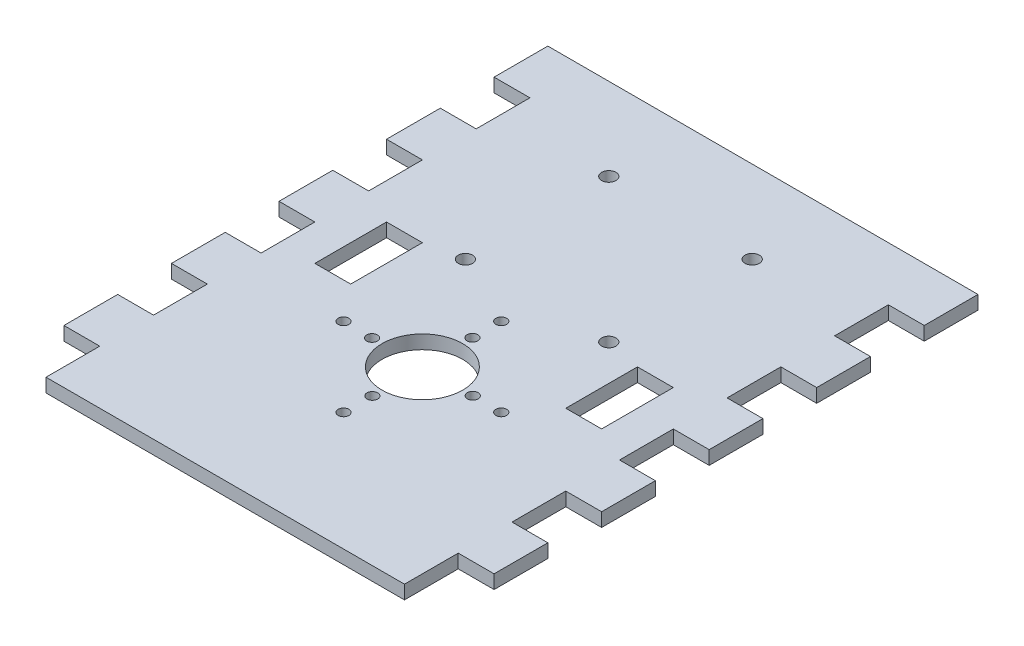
ISO-10303-21;
HEADER;
FILE_DESCRIPTION(('STEP AP214'),'2;1');
FILE_NAME('part.step','',(''),(''),'','','');
FILE_SCHEMA(('AUTOMOTIVE_DESIGN { 1 0 10303 214 1 1 1 1 }'));
ENDSEC;
DATA;
#1=APPLICATION_CONTEXT('core data for automotive mechanical design processes');
#2=APPLICATION_PROTOCOL_DEFINITION('international standard','automotive_design',2000,#1);
#3=PRODUCT_CONTEXT('',#1,'mechanical');
#4=PRODUCT('Part','Part','',(#3));
#5=PRODUCT_RELATED_PRODUCT_CATEGORY('part','',(#4));
#6=PRODUCT_DEFINITION_FORMATION('','',#4);
#7=PRODUCT_DEFINITION_CONTEXT('part definition',#1,'design');
#8=PRODUCT_DEFINITION('design','',#6,#7);
#9=PRODUCT_DEFINITION_SHAPE('','',#8);
#10=(LENGTH_UNIT() NAMED_UNIT(*) SI_UNIT(.MILLI.,.METRE.));
#11=(NAMED_UNIT(*) PLANE_ANGLE_UNIT() SI_UNIT($,.RADIAN.));
#12=(NAMED_UNIT(*) SI_UNIT($,.STERADIAN.) SOLID_ANGLE_UNIT());
#13=UNCERTAINTY_MEASURE_WITH_UNIT(LENGTH_MEASURE(1.E-05),#10,'distance_accuracy_value','');
#14=(GEOMETRIC_REPRESENTATION_CONTEXT(3) GLOBAL_UNCERTAINTY_ASSIGNED_CONTEXT((#13)) GLOBAL_UNIT_ASSIGNED_CONTEXT((#10,
#11,#12)) REPRESENTATION_CONTEXT('',''));
#15=CARTESIAN_POINT('',(0.,0.,0.));
#16=DIRECTION('',(0.,0.,1.));
#17=DIRECTION('',(1.,0.,0.));
#18=AXIS2_PLACEMENT_3D('',#15,#16,#17);
#19=CARTESIAN_POINT('',(100.,3.81,0.));
#20=DIRECTION('',(-1.,0.,0.));
#21=DIRECTION('',(0.,0.,1.));
#22=AXIS2_PLACEMENT_3D('',#19,#20,#21);
#23=PLANE('',#22);
#24=DIRECTION('',(0.,0.,-1.));
#25=VECTOR('',#24,1.);
#26=CARTESIAN_POINT('',(100.,3.81,0.));
#27=LINE('',#26,#25);
#28=CARTESIAN_POINT('',(100.,3.81,-30.));
#29=VERTEX_POINT('',#28);
#30=CARTESIAN_POINT('',(100.,3.81,-45.));
#31=VERTEX_POINT('',#30);
#32=EDGE_CURVE('E49',#29,#31,#27,.T.);
#33=ORIENTED_EDGE('',*,*,#32,.F.);
#34=DIRECTION('',(0.,-1.,0.));
#35=VECTOR('',#34,1.);
#36=CARTESIAN_POINT('',(99.9999999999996,21.8377563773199,-30.));
#37=LINE('',#36,#35);
#38=CARTESIAN_POINT('',(99.9999999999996,0.,-30.));
#39=VERTEX_POINT('',#38);
#40=EDGE_CURVE('E372',#29,#39,#37,.T.);
#41=ORIENTED_EDGE('',*,*,#40,.T.);
#42=DIRECTION('',(0.,0.,-1.));
#43=VECTOR('',#42,1.);
#44=CARTESIAN_POINT('',(100.,0.,0.));
#45=LINE('',#44,#43);
#46=CARTESIAN_POINT('',(100.,0.,-45.));
#47=VERTEX_POINT('',#46);
#48=EDGE_CURVE('E366',#39,#47,#45,.T.);
#49=ORIENTED_EDGE('',*,*,#48,.T.);
#50=DIRECTION('',(0.,-1.,0.));
#51=VECTOR('',#50,1.);
#52=CARTESIAN_POINT('',(99.9999999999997,21.8377563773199,-45.));
#53=LINE('',#52,#51);
#54=EDGE_CURVE('E422',#31,#47,#53,.T.);
#55=ORIENTED_EDGE('',*,*,#54,.F.);
#56=EDGE_LOOP('',(#33,#41,#49,#55));
#57=FACE_BOUND('',#56,.T.);
#58=ADVANCED_FACE('F34',(#57),#23,.F.);
#59=CARTESIAN_POINT('',(0.,3.81,0.));
#60=DIRECTION('',(1.,0.,0.));
#61=DIRECTION('',(0.,0.,-1.));
#62=AXIS2_PLACEMENT_3D('',#59,#60,#61);
#63=PLANE('',#62);
#64=DIRECTION('',(0.,0.,1.));
#65=VECTOR('',#64,1.);
#66=CARTESIAN_POINT('',(0.,0.,0.));
#67=LINE('',#66,#65);
#68=CARTESIAN_POINT('',(-3.14233320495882E-13,0.,-45.));
#69=VERTEX_POINT('',#68);
#70=CARTESIAN_POINT('',(-4.18977760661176E-13,0.,-30.));
#71=VERTEX_POINT('',#70);
#72=EDGE_CURVE('E854',#69,#71,#67,.T.);
#73=ORIENTED_EDGE('',*,*,#72,.T.);
#74=DIRECTION('',(0.,-1.,0.));
#75=VECTOR('',#74,1.);
#76=CARTESIAN_POINT('',(-4.18977760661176E-13,21.8377563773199,-30.));
#77=LINE('',#76,#75);
#78=CARTESIAN_POINT('',(-4.18977760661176E-13,3.81,-30.));
#79=VERTEX_POINT('',#78);
#80=EDGE_CURVE('E383',#79,#71,#77,.T.);
#81=ORIENTED_EDGE('',*,*,#80,.F.);
#82=DIRECTION('',(0.,0.,1.));
#83=VECTOR('',#82,1.);
#84=CARTESIAN_POINT('',(0.,3.81,0.));
#85=LINE('',#84,#83);
#86=CARTESIAN_POINT('',(0.,3.81,-45.));
#87=VERTEX_POINT('',#86);
#88=EDGE_CURVE('E845',#87,#79,#85,.T.);
#89=ORIENTED_EDGE('',*,*,#88,.F.);
#90=DIRECTION('',(0.,-1.,0.));
#91=VECTOR('',#90,1.);
#92=CARTESIAN_POINT('',(-3.14233320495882E-13,21.8377563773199,-45.));
#93=LINE('',#92,#91);
#94=EDGE_CURVE('E444',#87,#69,#93,.T.);
#95=ORIENTED_EDGE('',*,*,#94,.T.);
#96=EDGE_LOOP('',(#73,#81,#89,#95));
#97=FACE_BOUND('',#96,.T.);
#98=ADVANCED_FACE('F877',(#97),#63,.F.);
#99=CARTESIAN_POINT('',(100.,3.81,-60.));
#100=VERTEX_POINT('',#99);
#101=CARTESIAN_POINT('',(100.,3.81,-75.));
#102=VERTEX_POINT('',#101);
#103=EDGE_CURVE('E789',#100,#102,#27,.T.);
#104=ORIENTED_EDGE('',*,*,#103,.F.);
#105=DIRECTION('',(0.,-1.,0.));
#106=VECTOR('',#105,1.);
#107=CARTESIAN_POINT('',(99.9999999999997,21.8377563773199,-60.));
#108=LINE('',#107,#106);
#109=CARTESIAN_POINT('',(99.9999999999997,0.,-60.));
#110=VERTEX_POINT('',#109);
#111=EDGE_CURVE('E408',#100,#110,#108,.T.);
#112=ORIENTED_EDGE('',*,*,#111,.T.);
#113=CARTESIAN_POINT('',(100.,0.,-75.));
#114=VERTEX_POINT('',#113);
#115=EDGE_CURVE('E771',#110,#114,#45,.T.);
#116=ORIENTED_EDGE('',*,*,#115,.T.);
#117=DIRECTION('',(0.,-1.,0.));
#118=VECTOR('',#117,1.);
#119=CARTESIAN_POINT('',(99.9999999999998,21.8377563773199,-75.));
#120=LINE('',#119,#118);
#121=EDGE_CURVE('E473',#102,#114,#120,.T.);
#122=ORIENTED_EDGE('',*,*,#121,.F.);
#123=EDGE_LOOP('',(#104,#112,#116,#122));
#124=FACE_BOUND('',#123,.T.);
#125=ADVANCED_FACE('F787',(#124),#23,.F.);
#126=CARTESIAN_POINT('',(-2.09488880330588E-13,0.,-75.));
#127=VERTEX_POINT('',#126);
#128=CARTESIAN_POINT('',(-3.14233320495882E-13,0.,-60.));
#129=VERTEX_POINT('',#128);
#130=EDGE_CURVE('E856',#127,#129,#67,.T.);
#131=ORIENTED_EDGE('',*,*,#130,.T.);
#132=DIRECTION('',(0.,-1.,0.));
#133=VECTOR('',#132,1.);
#134=CARTESIAN_POINT('',(-3.14233320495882E-13,21.8377563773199,-60.));
#135=LINE('',#134,#133);
#136=CARTESIAN_POINT('',(-3.14233320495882E-13,3.81,-60.));
#137=VERTEX_POINT('',#136);
#138=EDGE_CURVE('E433',#137,#129,#135,.T.);
#139=ORIENTED_EDGE('',*,*,#138,.F.);
#140=CARTESIAN_POINT('',(0.,3.81,-75.));
#141=VERTEX_POINT('',#140);
#142=EDGE_CURVE('E843',#141,#137,#85,.T.);
#143=ORIENTED_EDGE('',*,*,#142,.F.);
#144=DIRECTION('',(0.,-1.,0.));
#145=VECTOR('',#144,1.);
#146=CARTESIAN_POINT('',(-2.09488880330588E-13,21.8377563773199,-75.));
#147=LINE('',#146,#145);
#148=EDGE_CURVE('E495',#141,#127,#147,.T.);
#149=ORIENTED_EDGE('',*,*,#148,.T.);
#150=EDGE_LOOP('',(#131,#139,#143,#149));
#151=FACE_BOUND('',#150,.T.);
#152=ADVANCED_FACE('F864',(#151),#63,.F.);
#153=CARTESIAN_POINT('',(100.,3.81,-90.));
#154=VERTEX_POINT('',#153);
#155=CARTESIAN_POINT('',(100.,3.81,-105.));
#156=VERTEX_POINT('',#155);
#157=EDGE_CURVE('E791',#154,#156,#27,.T.);
#158=ORIENTED_EDGE('',*,*,#157,.F.);
#159=DIRECTION('',(0.,-1.,0.));
#160=VECTOR('',#159,1.);
#161=CARTESIAN_POINT('',(99.9999999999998,21.8377563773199,-90.));
#162=LINE('',#161,#160);
#163=CARTESIAN_POINT('',(99.9999999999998,0.,-90.));
#164=VERTEX_POINT('',#163);
#165=EDGE_CURVE('E458',#154,#164,#162,.T.);
#166=ORIENTED_EDGE('',*,*,#165,.T.);
#167=CARTESIAN_POINT('',(100.,0.,-105.));
#168=VERTEX_POINT('',#167);
#169=EDGE_CURVE('E931',#164,#168,#45,.T.);
#170=ORIENTED_EDGE('',*,*,#169,.T.);
#171=DIRECTION('',(0.,-1.,0.));
#172=VECTOR('',#171,1.);
#173=CARTESIAN_POINT('',(99.9999999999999,21.8377563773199,-105.));
#174=LINE('',#173,#172);
#175=EDGE_CURVE('E524',#156,#168,#174,.T.);
#176=ORIENTED_EDGE('',*,*,#175,.F.);
#177=EDGE_LOOP('',(#158,#166,#170,#176));
#178=FACE_BOUND('',#177,.T.);
#179=ADVANCED_FACE('F905',(#178),#23,.F.);
#180=CARTESIAN_POINT('',(-1.04744440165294E-13,0.,-105.));
#181=VERTEX_POINT('',#180);
#182=CARTESIAN_POINT('',(-2.09488880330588E-13,0.,-90.));
#183=VERTEX_POINT('',#182);
#184=EDGE_CURVE('E750',#181,#183,#67,.T.);
#185=ORIENTED_EDGE('',*,*,#184,.T.);
#186=DIRECTION('',(0.,-1.,0.));
#187=VECTOR('',#186,1.);
#188=CARTESIAN_POINT('',(-2.09488880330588E-13,21.8377563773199,-90.));
#189=LINE('',#188,#187);
#190=CARTESIAN_POINT('',(-2.09488880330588E-13,3.81,-90.));
#191=VERTEX_POINT('',#190);
#192=EDGE_CURVE('E484',#191,#183,#189,.T.);
#193=ORIENTED_EDGE('',*,*,#192,.F.);
#194=CARTESIAN_POINT('',(0.,3.81,-105.));
#195=VERTEX_POINT('',#194);
#196=EDGE_CURVE('E738',#195,#191,#85,.T.);
#197=ORIENTED_EDGE('',*,*,#196,.F.);
#198=DIRECTION('',(0.,-1.,0.));
#199=VECTOR('',#198,1.);
#200=CARTESIAN_POINT('',(-1.04744440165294E-13,21.8377563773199,-105.));
#201=LINE('',#200,#199);
#202=EDGE_CURVE('E546',#195,#181,#201,.T.);
#203=ORIENTED_EDGE('',*,*,#202,.T.);
#204=EDGE_LOOP('',(#185,#193,#197,#203));
#205=FACE_BOUND('',#204,.T.);
#206=ADVANCED_FACE('F840',(#205),#63,.F.);
#207=CARTESIAN_POINT('',(100.,3.81,-120.));
#208=VERTEX_POINT('',#207);
#209=CARTESIAN_POINT('',(100.,3.81,-135.));
#210=VERTEX_POINT('',#209);
#211=EDGE_CURVE('E741',#208,#210,#27,.T.);
#212=ORIENTED_EDGE('',*,*,#211,.F.);
#213=DIRECTION('',(0.,-1.,0.));
#214=VECTOR('',#213,1.);
#215=CARTESIAN_POINT('',(99.9999999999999,21.8377563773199,-120.));
#216=LINE('',#215,#214);
#217=CARTESIAN_POINT('',(99.9999999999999,0.,-120.));
#218=VERTEX_POINT('',#217);
#219=EDGE_CURVE('E509',#208,#218,#216,.T.);
#220=ORIENTED_EDGE('',*,*,#219,.T.);
#221=CARTESIAN_POINT('',(100.,0.,-135.));
#222=VERTEX_POINT('',#221);
#223=EDGE_CURVE('E752',#218,#222,#45,.T.);
#224=ORIENTED_EDGE('',*,*,#223,.T.);
#225=DIRECTION('',(0.,-1.,0.));
#226=VECTOR('',#225,1.);
#227=CARTESIAN_POINT('',(100.,21.8377563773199,-135.));
#228=LINE('',#227,#226);
#229=EDGE_CURVE('E560',#210,#222,#228,.T.);
#230=ORIENTED_EDGE('',*,*,#229,.F.);
#231=EDGE_LOOP('',(#212,#220,#224,#230));
#232=FACE_BOUND('',#231,.T.);
#233=ADVANCED_FACE('F799',(#232),#23,.F.);
#234=CARTESIAN_POINT('',(0.,0.,-135.));
#235=VERTEX_POINT('',#234);
#236=CARTESIAN_POINT('',(-1.04744440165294E-13,0.,-120.));
#237=VERTEX_POINT('',#236);
#238=EDGE_CURVE('E746',#235,#237,#67,.T.);
#239=ORIENTED_EDGE('',*,*,#238,.T.);
#240=DIRECTION('',(0.,-1.,0.));
#241=VECTOR('',#240,1.);
#242=CARTESIAN_POINT('',(-1.04744440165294E-13,21.8377563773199,-120.));
#243=LINE('',#242,#241);
#244=CARTESIAN_POINT('',(-1.04744440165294E-13,3.81,-120.));
#245=VERTEX_POINT('',#244);
#246=EDGE_CURVE('E535',#245,#237,#243,.T.);
#247=ORIENTED_EDGE('',*,*,#246,.F.);
#248=CARTESIAN_POINT('',(0.,3.81,-135.));
#249=VERTEX_POINT('',#248);
#250=EDGE_CURVE('E734',#249,#245,#85,.T.);
#251=ORIENTED_EDGE('',*,*,#250,.F.);
#252=DIRECTION('',(0.,-1.,0.));
#253=VECTOR('',#252,1.);
#254=CARTESIAN_POINT('',(0.,21.8377563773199,-135.));
#255=LINE('',#254,#253);
#256=EDGE_CURVE('E585',#249,#235,#255,.T.);
#257=ORIENTED_EDGE('',*,*,#256,.T.);
#258=EDGE_LOOP('',(#239,#247,#251,#257));
#259=FACE_BOUND('',#258,.T.);
#260=ADVANCED_FACE('F822',(#259),#63,.F.);
#261=CARTESIAN_POINT('',(100.,0.,0.));
#262=VERTEX_POINT('',#261);
#263=CARTESIAN_POINT('',(100.,0.,-15.));
#264=VERTEX_POINT('',#263);
#265=EDGE_CURVE('E753',#262,#264,#45,.T.);
#266=ORIENTED_EDGE('',*,*,#265,.T.);
#267=DIRECTION('',(0.,-1.,0.));
#268=VECTOR('',#267,1.);
#269=CARTESIAN_POINT('',(99.9999999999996,21.8377563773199,-15.));
#270=LINE('',#269,#268);
#271=CARTESIAN_POINT('',(100.,3.81,-15.));
#272=VERTEX_POINT('',#271);
#273=EDGE_CURVE('E57',#272,#264,#270,.T.);
#274=ORIENTED_EDGE('',*,*,#273,.F.);
#275=CARTESIAN_POINT('',(100.,3.81,0.));
#276=VERTEX_POINT('',#275);
#277=EDGE_CURVE('E742',#276,#272,#27,.T.);
#278=ORIENTED_EDGE('',*,*,#277,.F.);
#279=DIRECTION('',(0.,-1.,0.));
#280=VECTOR('',#279,1.);
#281=CARTESIAN_POINT('',(100.,3.81,0.));
#282=LINE('',#281,#280);
#283=EDGE_CURVE('E42',#276,#262,#282,.T.);
#284=ORIENTED_EDGE('',*,*,#283,.T.);
#285=EDGE_LOOP('',(#266,#274,#278,#284));
#286=FACE_BOUND('',#285,.T.);
#287=ADVANCED_FACE('F759',(#286),#23,.F.);
#288=CARTESIAN_POINT('',(0.,3.81,0.));
#289=DIRECTION('',(0.,-1.,0.));
#290=DIRECTION('',(0.,0.,-1.));
#291=AXIS2_PLACEMENT_3D('',#288,#289,#290);
#292=PLANE('',#291);
#293=DIRECTION('',(0.,0.,1.));
#294=VECTOR('',#293,1.);
#295=CARTESIAN_POINT('',(9.99999999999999,3.81,-65.));
#296=LINE('',#295,#294);
#297=CARTESIAN_POINT('',(9.99999999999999,3.81,-85.));
#298=VERTEX_POINT('',#297);
#299=CARTESIAN_POINT('',(9.99999999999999,3.81,-65.));
#300=VERTEX_POINT('',#299);
#301=EDGE_CURVE('E673',#298,#300,#296,.T.);
#302=ORIENTED_EDGE('',*,*,#301,.F.);
#303=DIRECTION('',(-1.,0.,0.));
#304=VECTOR('',#303,1.);
#305=CARTESIAN_POINT('',(20.,3.81,-85.));
#306=LINE('',#305,#304);
#307=CARTESIAN_POINT('',(20.,3.81,-85.));
#308=VERTEX_POINT('',#307);
#309=EDGE_CURVE('E681',#308,#298,#306,.T.);
#310=ORIENTED_EDGE('',*,*,#309,.F.);
#311=DIRECTION('',(0.,0.,-1.));
#312=VECTOR('',#311,1.);
#313=CARTESIAN_POINT('',(20.,3.81,-65.));
#314=LINE('',#313,#312);
#315=CARTESIAN_POINT('',(20.,3.81,-65.));
#316=VERTEX_POINT('',#315);
#317=EDGE_CURVE('E678',#316,#308,#314,.T.);
#318=ORIENTED_EDGE('',*,*,#317,.F.);
#319=DIRECTION('',(1.,0.,0.));
#320=VECTOR('',#319,1.);
#321=CARTESIAN_POINT('',(20.,3.81,-65.));
#322=LINE('',#321,#320);
#323=EDGE_CURVE('E675',#300,#316,#322,.T.);
#324=ORIENTED_EDGE('',*,*,#323,.F.);
#325=EDGE_LOOP('',(#302,#310,#318,#324));
#326=FACE_BOUND('',#325,.T.);
#327=DIRECTION('',(-1.,0.,0.));
#328=VECTOR('',#327,1.);
#329=CARTESIAN_POINT('',(0.,3.81,-150.));
#330=LINE('',#329,#328);
#331=CARTESIAN_POINT('',(110.,3.81,-150.));
#332=VERTEX_POINT('',#331);
#333=CARTESIAN_POINT('',(-10.,3.81,-150.));
#334=VERTEX_POINT('',#333);
#335=EDGE_CURVE('E744',#332,#334,#330,.T.);
#336=ORIENTED_EDGE('',*,*,#335,.T.);
#337=DIRECTION('',(0.,0.,1.));
#338=VECTOR('',#337,1.);
#339=CARTESIAN_POINT('',(-10.,3.81,-150.));
#340=LINE('',#339,#338);
#341=CARTESIAN_POINT('',(-10.,3.81,-135.));
#342=VERTEX_POINT('',#341);
#343=EDGE_CURVE('E576',#334,#342,#340,.T.);
#344=ORIENTED_EDGE('',*,*,#343,.T.);
#345=DIRECTION('',(1.,0.,0.));
#346=VECTOR('',#345,1.);
#347=CARTESIAN_POINT('',(0.,3.81,-135.));
#348=LINE('',#347,#346);
#349=EDGE_CURVE('E578',#342,#249,#348,.T.);
#350=ORIENTED_EDGE('',*,*,#349,.T.);
#351=ORIENTED_EDGE('',*,*,#250,.T.);
#352=DIRECTION('',(-1.,0.,0.));
#353=VECTOR('',#352,1.);
#354=CARTESIAN_POINT('',(-1.04744440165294E-13,3.81,-120.));
#355=LINE('',#354,#353);
#356=CARTESIAN_POINT('',(-10.0000000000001,3.81,-120.));
#357=VERTEX_POINT('',#356);
#358=EDGE_CURVE('E534',#245,#357,#355,.T.);
#359=ORIENTED_EDGE('',*,*,#358,.T.);
#360=DIRECTION('',(0.,0.,1.));
#361=VECTOR('',#360,1.);
#362=CARTESIAN_POINT('',(-10.0000000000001,3.81,-120.));
#363=LINE('',#362,#361);
#364=CARTESIAN_POINT('',(-10.0000000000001,3.81,-105.));
#365=VERTEX_POINT('',#364);
#366=EDGE_CURVE('E532',#357,#365,#363,.T.);
#367=ORIENTED_EDGE('',*,*,#366,.T.);
#368=DIRECTION('',(1.,0.,0.));
#369=VECTOR('',#368,1.);
#370=CARTESIAN_POINT('',(-1.04744440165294E-13,3.81,-105.));
#371=LINE('',#370,#369);
#372=EDGE_CURVE('E537',#365,#195,#371,.T.);
#373=ORIENTED_EDGE('',*,*,#372,.T.);
#374=ORIENTED_EDGE('',*,*,#196,.T.);
#375=DIRECTION('',(-1.,0.,0.));
#376=VECTOR('',#375,1.);
#377=CARTESIAN_POINT('',(-2.09488880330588E-13,3.81,-90.));
#378=LINE('',#377,#376);
#379=CARTESIAN_POINT('',(-10.0000000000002,3.81,-90.));
#380=VERTEX_POINT('',#379);
#381=EDGE_CURVE('E483',#191,#380,#378,.T.);
#382=ORIENTED_EDGE('',*,*,#381,.T.);
#383=DIRECTION('',(0.,0.,1.));
#384=VECTOR('',#383,1.);
#385=CARTESIAN_POINT('',(-10.0000000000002,3.81,-90.));
#386=LINE('',#385,#384);
#387=CARTESIAN_POINT('',(-10.0000000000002,3.81,-75.));
#388=VERTEX_POINT('',#387);
#389=EDGE_CURVE('E481',#380,#388,#386,.T.);
#390=ORIENTED_EDGE('',*,*,#389,.T.);
#391=DIRECTION('',(1.,0.,0.));
#392=VECTOR('',#391,1.);
#393=CARTESIAN_POINT('',(-2.09488880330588E-13,3.81,-75.));
#394=LINE('',#393,#392);
#395=EDGE_CURVE('E486',#388,#141,#394,.T.);
#396=ORIENTED_EDGE('',*,*,#395,.T.);
#397=ORIENTED_EDGE('',*,*,#142,.T.);
#398=DIRECTION('',(-1.,0.,0.));
#399=VECTOR('',#398,1.);
#400=CARTESIAN_POINT('',(-3.14233320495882E-13,3.81,-60.));
#401=LINE('',#400,#399);
#402=CARTESIAN_POINT('',(-10.0000000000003,3.81,-60.));
#403=VERTEX_POINT('',#402);
#404=EDGE_CURVE('E432',#137,#403,#401,.T.);
#405=ORIENTED_EDGE('',*,*,#404,.T.);
#406=DIRECTION('',(0.,0.,1.));
#407=VECTOR('',#406,1.);
#408=CARTESIAN_POINT('',(-10.0000000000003,3.81,-60.));
#409=LINE('',#408,#407);
#410=CARTESIAN_POINT('',(-10.0000000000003,3.81,-45.));
#411=VERTEX_POINT('',#410);
#412=EDGE_CURVE('E430',#403,#411,#409,.T.);
#413=ORIENTED_EDGE('',*,*,#412,.T.);
#414=DIRECTION('',(1.,0.,0.));
#415=VECTOR('',#414,1.);
#416=CARTESIAN_POINT('',(-3.14233320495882E-13,3.81,-45.));
#417=LINE('',#416,#415);
#418=EDGE_CURVE('E435',#411,#87,#417,.T.);
#419=ORIENTED_EDGE('',*,*,#418,.T.);
#420=ORIENTED_EDGE('',*,*,#88,.T.);
#421=DIRECTION('',(-1.,0.,0.));
#422=VECTOR('',#421,1.);
#423=CARTESIAN_POINT('',(-4.18977760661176E-13,3.81,-30.));
#424=LINE('',#423,#422);
#425=CARTESIAN_POINT('',(-10.0000000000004,3.81,-30.));
#426=VERTEX_POINT('',#425);
#427=EDGE_CURVE('E382',#79,#426,#424,.T.);
#428=ORIENTED_EDGE('',*,*,#427,.T.);
#429=DIRECTION('',(0.,0.,1.));
#430=VECTOR('',#429,1.);
#431=CARTESIAN_POINT('',(-10.0000000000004,3.81,-30.));
#432=LINE('',#431,#430);
#433=CARTESIAN_POINT('',(-10.0000000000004,3.81,-15.));
#434=VERTEX_POINT('',#433);
#435=EDGE_CURVE('E380',#426,#434,#432,.T.);
#436=ORIENTED_EDGE('',*,*,#435,.T.);
#437=DIRECTION('',(1.,0.,0.));
#438=VECTOR('',#437,1.);
#439=CARTESIAN_POINT('',(-4.18977760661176E-13,3.81,-15.));
#440=LINE('',#439,#438);
#441=CARTESIAN_POINT('',(0.,3.81,-15.));
#442=VERTEX_POINT('',#441);
#443=EDGE_CURVE('E385',#434,#442,#440,.T.);
#444=ORIENTED_EDGE('',*,*,#443,.T.);
#445=CARTESIAN_POINT('',(0.,3.81,0.));
#446=VERTEX_POINT('',#445);
#447=EDGE_CURVE('E739',#442,#446,#85,.T.);
#448=ORIENTED_EDGE('',*,*,#447,.T.);
#449=DIRECTION('',(1.,0.,0.));
#450=VECTOR('',#449,1.);
#451=CARTESIAN_POINT('',(0.,3.81,0.));
#452=LINE('',#451,#450);
#453=EDGE_CURVE('E737',#446,#276,#452,.T.);
#454=ORIENTED_EDGE('',*,*,#453,.T.);
#455=ORIENTED_EDGE('',*,*,#277,.T.);
#456=DIRECTION('',(1.,0.,0.));
#457=VECTOR('',#456,1.);
#458=CARTESIAN_POINT('',(99.9999999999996,3.81,-15.));
#459=LINE('',#458,#457);
#460=CARTESIAN_POINT('',(110.,3.81,-15.));
#461=VERTEX_POINT('',#460);
#462=EDGE_CURVE('E374',#272,#461,#459,.T.);
#463=ORIENTED_EDGE('',*,*,#462,.T.);
#464=DIRECTION('',(0.,0.,-1.));
#465=VECTOR('',#464,1.);
#466=CARTESIAN_POINT('',(110.,3.81,-30.));
#467=LINE('',#466,#465);
#468=CARTESIAN_POINT('',(110.,3.81,-30.));
#469=VERTEX_POINT('',#468);
#470=EDGE_CURVE('E377',#461,#469,#467,.T.);
#471=ORIENTED_EDGE('',*,*,#470,.T.);
#472=DIRECTION('',(-1.,0.,0.));
#473=VECTOR('',#472,1.);
#474=CARTESIAN_POINT('',(99.9999999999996,3.81,-30.));
#475=LINE('',#474,#473);
#476=EDGE_CURVE('E348',#469,#29,#475,.T.);
#477=ORIENTED_EDGE('',*,*,#476,.T.);
#478=ORIENTED_EDGE('',*,*,#32,.T.);
#479=DIRECTION('',(1.,0.,0.));
#480=VECTOR('',#479,1.);
#481=CARTESIAN_POINT('',(99.9999999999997,3.81,-45.));
#482=LINE('',#481,#480);
#483=CARTESIAN_POINT('',(110.,3.81,-45.));
#484=VERTEX_POINT('',#483);
#485=EDGE_CURVE('E405',#31,#484,#482,.T.);
#486=ORIENTED_EDGE('',*,*,#485,.T.);
#487=DIRECTION('',(0.,0.,-1.));
#488=VECTOR('',#487,1.);
#489=CARTESIAN_POINT('',(110.,3.81,-60.));
#490=LINE('',#489,#488);
#491=CARTESIAN_POINT('',(110.,3.81,-60.));
#492=VERTEX_POINT('',#491);
#493=EDGE_CURVE('E411',#484,#492,#490,.T.);
#494=ORIENTED_EDGE('',*,*,#493,.T.);
#495=DIRECTION('',(-1.,0.,0.));
#496=VECTOR('',#495,1.);
#497=CARTESIAN_POINT('',(99.9999999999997,3.81,-60.));
#498=LINE('',#497,#496);
#499=EDGE_CURVE('E407',#492,#100,#498,.T.);
#500=ORIENTED_EDGE('',*,*,#499,.T.);
#501=ORIENTED_EDGE('',*,*,#103,.T.);
#502=DIRECTION('',(1.,0.,0.));
#503=VECTOR('',#502,1.);
#504=CARTESIAN_POINT('',(99.9999999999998,3.81,-75.));
#505=LINE('',#504,#503);
#506=CARTESIAN_POINT('',(110.,3.81,-75.));
#507=VERTEX_POINT('',#506);
#508=EDGE_CURVE('E455',#102,#507,#505,.T.);
#509=ORIENTED_EDGE('',*,*,#508,.T.);
#510=DIRECTION('',(0.,0.,-1.));
#511=VECTOR('',#510,1.);
#512=CARTESIAN_POINT('',(110.,3.81,-90.));
#513=LINE('',#512,#511);
#514=CARTESIAN_POINT('',(110.,3.81,-90.));
#515=VERTEX_POINT('',#514);
#516=EDGE_CURVE('E461',#507,#515,#513,.T.);
#517=ORIENTED_EDGE('',*,*,#516,.T.);
#518=DIRECTION('',(-1.,0.,0.));
#519=VECTOR('',#518,1.);
#520=CARTESIAN_POINT('',(99.9999999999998,3.81,-90.));
#521=LINE('',#520,#519);
#522=EDGE_CURVE('E457',#515,#154,#521,.T.);
#523=ORIENTED_EDGE('',*,*,#522,.T.);
#524=ORIENTED_EDGE('',*,*,#157,.T.);
#525=DIRECTION('',(1.,0.,0.));
#526=VECTOR('',#525,1.);
#527=CARTESIAN_POINT('',(99.9999999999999,3.81,-105.));
#528=LINE('',#527,#526);
#529=CARTESIAN_POINT('',(110.,3.81,-105.));
#530=VERTEX_POINT('',#529);
#531=EDGE_CURVE('E506',#156,#530,#528,.T.);
#532=ORIENTED_EDGE('',*,*,#531,.T.);
#533=DIRECTION('',(0.,0.,-1.));
#534=VECTOR('',#533,1.);
#535=CARTESIAN_POINT('',(110.,3.81,-120.));
#536=LINE('',#535,#534);
#537=CARTESIAN_POINT('',(110.,3.81,-120.));
#538=VERTEX_POINT('',#537);
#539=EDGE_CURVE('E512',#530,#538,#536,.T.);
#540=ORIENTED_EDGE('',*,*,#539,.T.);
#541=DIRECTION('',(-1.,0.,0.));
#542=VECTOR('',#541,1.);
#543=CARTESIAN_POINT('',(99.9999999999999,3.81,-120.));
#544=LINE('',#543,#542);
#545=EDGE_CURVE('E508',#538,#208,#544,.T.);
#546=ORIENTED_EDGE('',*,*,#545,.T.);
#547=ORIENTED_EDGE('',*,*,#211,.T.);
#548=DIRECTION('',(1.,0.,0.));
#549=VECTOR('',#548,1.);
#550=CARTESIAN_POINT('',(100.,3.81,-135.));
#551=LINE('',#550,#549);
#552=CARTESIAN_POINT('',(110.,3.81,-135.));
#553=VERTEX_POINT('',#552);
#554=EDGE_CURVE('E557',#210,#553,#551,.T.);
#555=ORIENTED_EDGE('',*,*,#554,.T.);
#556=DIRECTION('',(0.,0.,-1.));
#557=VECTOR('',#556,1.);
#558=CARTESIAN_POINT('',(110.,3.81,-150.));
#559=LINE('',#558,#557);
#560=EDGE_CURVE('E559',#553,#332,#559,.T.);
#561=ORIENTED_EDGE('',*,*,#560,.T.);
#562=EDGE_LOOP('',(#336,#344,#350,#351,#359,#367,#373,#374,#382,#390,#396,#397,#405,#413,#419,
#420,#428,#436,#444,#448,#454,#455,#463,#471,#477,#478,#486,#494,#500,#501,#509,#517,#523,#524,
#532,#540,#546,#547,#555,#561));
#563=FACE_BOUND('',#562,.T.);
#564=CARTESIAN_POINT('',(50.,3.81,-55.));
#565=DIRECTION('',(0.,1.,0.));
#566=DIRECTION('',(0.,0.,1.));
#567=AXIS2_PLACEMENT_3D('',#564,#565,#566);
#568=CIRCLE('',#567,11.25);
#569=CARTESIAN_POINT('',(50.,3.81,-43.75));
#570=VERTEX_POINT('',#569);
#571=EDGE_CURVE('E728',#570,#570,#568,.T.);
#572=ORIENTED_EDGE('',*,*,#571,.F.);
#573=EDGE_LOOP('',(#572));
#574=FACE_BOUND('',#573,.T.);
#575=CARTESIAN_POINT('',(49.9598110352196,3.81,-68.9999423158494));
#576=DIRECTION('',(0.,1.,0.));
#577=DIRECTION('',(0.,0.,1.));
#578=AXIS2_PLACEMENT_3D('',#575,#576,#577);
#579=CIRCLE('',#578,1.5);
#580=CARTESIAN_POINT('',(49.9598110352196,3.81,-67.4999423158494));
#581=VERTEX_POINT('',#580);
#582=EDGE_CURVE('E722',#581,#581,#579,.T.);
#583=ORIENTED_EDGE('',*,*,#582,.F.);
#584=EDGE_LOOP('',(#583));
#585=FACE_BOUND('',#584,.T.);
#586=CARTESIAN_POINT('',(63.9999423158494,3.81,-55.0401889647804));
#587=DIRECTION('',(0.,1.,0.));
#588=DIRECTION('',(0.,0.,1.));
#589=AXIS2_PLACEMENT_3D('',#586,#587,#588);
#590=CIRCLE('',#589,1.5);
#591=CARTESIAN_POINT('',(63.9999423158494,3.81,-53.5401889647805));
#592=VERTEX_POINT('',#591);
#593=EDGE_CURVE('E716',#592,#592,#590,.T.);
#594=ORIENTED_EDGE('',*,*,#593,.F.);
#595=EDGE_LOOP('',(#594));
#596=FACE_BOUND('',#595,.T.);
#597=CARTESIAN_POINT('',(50.0401889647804,3.81,-41.0000576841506));
#598=DIRECTION('',(0.,1.,0.));
#599=DIRECTION('',(0.,0.,1.));
#600=AXIS2_PLACEMENT_3D('',#597,#598,#599);
#601=CIRCLE('',#600,1.50000000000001);
#602=CARTESIAN_POINT('',(50.0401889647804,3.81,-39.5000576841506));
#603=VERTEX_POINT('',#602);
#604=EDGE_CURVE('E710',#603,#603,#601,.T.);
#605=ORIENTED_EDGE('',*,*,#604,.F.);
#606=EDGE_LOOP('',(#605));
#607=FACE_BOUND('',#606,.T.);
#608=CARTESIAN_POINT('',(36.0000576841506,3.81,-54.9598110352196));
#609=DIRECTION('',(0.,1.,0.));
#610=DIRECTION('',(0.,0.,1.));
#611=AXIS2_PLACEMENT_3D('',#608,#609,#610);
#612=CIRCLE('',#611,1.50000000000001);
#613=CARTESIAN_POINT('',(36.0000576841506,3.81,-53.4598110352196));
#614=VERTEX_POINT('',#613);
#615=EDGE_CURVE('E704',#614,#614,#612,.T.);
#616=ORIENTED_EDGE('',*,*,#615,.F.);
#617=EDGE_LOOP('',(#616));
#618=FACE_BOUND('',#617,.T.);
#619=DIRECTION('',(0.,0.,1.));
#620=VECTOR('',#619,1.);
#621=CARTESIAN_POINT('',(80.,3.81,-65.));
#622=LINE('',#621,#620);
#623=CARTESIAN_POINT('',(80.,3.81,-85.));
#624=VERTEX_POINT('',#623);
#625=CARTESIAN_POINT('',(80.,3.81,-65.));
#626=VERTEX_POINT('',#625);
#627=EDGE_CURVE('E642',#624,#626,#622,.T.);
#628=ORIENTED_EDGE('',*,*,#627,.F.);
#629=DIRECTION('',(-1.,0.,0.));
#630=VECTOR('',#629,1.);
#631=CARTESIAN_POINT('',(80.,3.81,-85.));
#632=LINE('',#631,#630);
#633=CARTESIAN_POINT('',(90.,3.81,-85.));
#634=VERTEX_POINT('',#633);
#635=EDGE_CURVE('E650',#634,#624,#632,.T.);
#636=ORIENTED_EDGE('',*,*,#635,.F.);
#637=DIRECTION('',(0.,0.,-1.));
#638=VECTOR('',#637,1.);
#639=CARTESIAN_POINT('',(90.,3.81,-65.));
#640=LINE('',#639,#638);
#641=CARTESIAN_POINT('',(90.,3.81,-65.));
#642=VERTEX_POINT('',#641);
#643=EDGE_CURVE('E647',#642,#634,#640,.T.);
#644=ORIENTED_EDGE('',*,*,#643,.F.);
#645=DIRECTION('',(1.,0.,0.));
#646=VECTOR('',#645,1.);
#647=CARTESIAN_POINT('',(80.,3.81,-65.));
#648=LINE('',#647,#646);
#649=EDGE_CURVE('E644',#626,#642,#648,.T.);
#650=ORIENTED_EDGE('',*,*,#649,.F.);
#651=EDGE_LOOP('',(#628,#636,#644,#650));
#652=FACE_BOUND('',#651,.T.);
#653=CARTESIAN_POINT('',(50.,3.81,-33.));
#654=DIRECTION('',(0.,1.,0.));
#655=DIRECTION('',(0.,0.,1.));
#656=AXIS2_PLACEMENT_3D('',#653,#654,#655);
#657=CIRCLE('',#656,1.5);
#658=CARTESIAN_POINT('',(50.,3.81,-31.5));
#659=VERTEX_POINT('',#658);
#660=EDGE_CURVE('E636',#659,#659,#657,.T.);
#661=ORIENTED_EDGE('',*,*,#660,.F.);
#662=EDGE_LOOP('',(#661));
#663=FACE_BOUND('',#662,.T.);
#664=CARTESIAN_POINT('',(30.,3.81,-127.));
#665=DIRECTION('',(0.,1.,0.));
#666=DIRECTION('',(0.,0.,1.));
#667=AXIS2_PLACEMENT_3D('',#664,#665,#666);
#668=CIRCLE('',#667,2.);
#669=CARTESIAN_POINT('',(30.,3.81,-125.));
#670=VERTEX_POINT('',#669);
#671=EDGE_CURVE('E630',#670,#670,#668,.T.);
#672=ORIENTED_EDGE('',*,*,#671,.F.);
#673=EDGE_LOOP('',(#672));
#674=FACE_BOUND('',#673,.T.);
#675=CARTESIAN_POINT('',(28.,3.81,-55.));
#676=DIRECTION('',(0.,1.,0.));
#677=DIRECTION('',(0.,0.,1.));
#678=AXIS2_PLACEMENT_3D('',#675,#676,#677);
#679=CIRCLE('',#678,1.5);
#680=CARTESIAN_POINT('',(28.,3.81,-53.5));
#681=VERTEX_POINT('',#680);
#682=EDGE_CURVE('E624',#681,#681,#679,.T.);
#683=ORIENTED_EDGE('',*,*,#682,.F.);
#684=EDGE_LOOP('',(#683));
#685=FACE_BOUND('',#684,.T.);
#686=CARTESIAN_POINT('',(50.,3.81,-77.));
#687=DIRECTION('',(0.,1.,0.));
#688=DIRECTION('',(0.,0.,1.));
#689=AXIS2_PLACEMENT_3D('',#686,#687,#688);
#690=CIRCLE('',#689,1.5);
#691=CARTESIAN_POINT('',(50.,3.81,-75.5));
#692=VERTEX_POINT('',#691);
#693=EDGE_CURVE('E618',#692,#692,#690,.T.);
#694=ORIENTED_EDGE('',*,*,#693,.F.);
#695=EDGE_LOOP('',(#694));
#696=FACE_BOUND('',#695,.T.);
#697=CARTESIAN_POINT('',(72.,3.81,-55.));
#698=DIRECTION('',(0.,1.,0.));
#699=DIRECTION('',(0.,0.,1.));
#700=AXIS2_PLACEMENT_3D('',#697,#698,#699);
#701=CIRCLE('',#700,1.5);
#702=CARTESIAN_POINT('',(72.,3.81,-53.5));
#703=VERTEX_POINT('',#702);
#704=EDGE_CURVE('E612',#703,#703,#701,.T.);
#705=ORIENTED_EDGE('',*,*,#704,.F.);
#706=EDGE_LOOP('',(#705));
#707=FACE_BOUND('',#706,.T.);
#708=CARTESIAN_POINT('',(70.,3.81,-127.));
#709=DIRECTION('',(0.,1.,0.));
#710=DIRECTION('',(0.,0.,1.));
#711=AXIS2_PLACEMENT_3D('',#708,#709,#710);
#712=CIRCLE('',#711,2.00000000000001);
#713=CARTESIAN_POINT('',(70.,3.81,-125.));
#714=VERTEX_POINT('',#713);
#715=EDGE_CURVE('E606',#714,#714,#712,.T.);
#716=ORIENTED_EDGE('',*,*,#715,.F.);
#717=EDGE_LOOP('',(#716));
#718=FACE_BOUND('',#717,.T.);
#719=CARTESIAN_POINT('',(70.0000000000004,3.81,-87.));
#720=DIRECTION('',(0.,1.,0.));
#721=DIRECTION('',(0.,0.,1.));
#722=AXIS2_PLACEMENT_3D('',#719,#720,#721);
#723=CIRCLE('',#722,2.00000000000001);
#724=CARTESIAN_POINT('',(70.0000000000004,3.81,-85.));
#725=VERTEX_POINT('',#724);
#726=EDGE_CURVE('E600',#725,#725,#723,.T.);
#727=ORIENTED_EDGE('',*,*,#726,.F.);
#728=EDGE_LOOP('',(#727));
#729=FACE_BOUND('',#728,.T.);
#730=CARTESIAN_POINT('',(30.0000000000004,3.81,-87.));
#731=DIRECTION('',(0.,1.,0.));
#732=DIRECTION('',(0.,0.,1.));
#733=AXIS2_PLACEMENT_3D('',#730,#731,#732);
#734=CIRCLE('',#733,2.);
#735=CARTESIAN_POINT('',(30.0000000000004,3.81,-85.));
#736=VERTEX_POINT('',#735);
#737=EDGE_CURVE('E594',#736,#736,#734,.T.);
#738=ORIENTED_EDGE('',*,*,#737,.F.);
#739=EDGE_LOOP('',(#738));
#740=FACE_BOUND('',#739,.T.);
#741=ADVANCED_FACE('F768',(#326,#563,#574,#585,#596,#607,#618,#652,#663,#674,#685,#696,#707,
#718,#729,#740),#292,.F.);
#742=CARTESIAN_POINT('',(0.,0.,0.));
#743=DIRECTION('',(0.,-1.,0.));
#744=DIRECTION('',(0.,0.,-1.));
#745=AXIS2_PLACEMENT_3D('',#742,#743,#744);
#746=PLANE('',#745);
#747=CARTESIAN_POINT('',(70.0000000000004,0.,-87.));
#748=DIRECTION('',(0.,1.,0.));
#749=DIRECTION('',(0.,0.,1.));
#750=AXIS2_PLACEMENT_3D('',#747,#748,#749);
#751=CIRCLE('',#750,2.00000000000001);
#752=CARTESIAN_POINT('',(70.0000000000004,0.,-85.));
#753=VERTEX_POINT('',#752);
#754=EDGE_CURVE('E597',#753,#753,#751,.T.);
#755=ORIENTED_EDGE('',*,*,#754,.T.);
#756=EDGE_LOOP('',(#755));
#757=FACE_BOUND('',#756,.T.);
#758=CARTESIAN_POINT('',(72.,0.,-55.));
#759=DIRECTION('',(0.,1.,0.));
#760=DIRECTION('',(0.,0.,1.));
#761=AXIS2_PLACEMENT_3D('',#758,#759,#760);
#762=CIRCLE('',#761,1.5);
#763=CARTESIAN_POINT('',(72.,0.,-53.5));
#764=VERTEX_POINT('',#763);
#765=EDGE_CURVE('E609',#764,#764,#762,.T.);
#766=ORIENTED_EDGE('',*,*,#765,.T.);
#767=EDGE_LOOP('',(#766));
#768=FACE_BOUND('',#767,.T.);
#769=CARTESIAN_POINT('',(28.,0.,-55.));
#770=DIRECTION('',(0.,1.,0.));
#771=DIRECTION('',(0.,0.,1.));
#772=AXIS2_PLACEMENT_3D('',#769,#770,#771);
#773=CIRCLE('',#772,1.5);
#774=CARTESIAN_POINT('',(28.,0.,-53.5));
#775=VERTEX_POINT('',#774);
#776=EDGE_CURVE('E621',#775,#775,#773,.T.);
#777=ORIENTED_EDGE('',*,*,#776,.T.);
#778=EDGE_LOOP('',(#777));
#779=FACE_BOUND('',#778,.T.);
#780=CARTESIAN_POINT('',(50.,0.,-33.));
#781=DIRECTION('',(0.,1.,0.));
#782=DIRECTION('',(0.,0.,1.));
#783=AXIS2_PLACEMENT_3D('',#780,#781,#782);
#784=CIRCLE('',#783,1.5);
#785=CARTESIAN_POINT('',(50.,0.,-31.5));
#786=VERTEX_POINT('',#785);
#787=EDGE_CURVE('E633',#786,#786,#784,.T.);
#788=ORIENTED_EDGE('',*,*,#787,.T.);
#789=EDGE_LOOP('',(#788));
#790=FACE_BOUND('',#789,.T.);
#791=CARTESIAN_POINT('',(50.0401889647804,0.,-41.0000576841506));
#792=DIRECTION('',(0.,1.,0.));
#793=DIRECTION('',(0.,0.,1.));
#794=AXIS2_PLACEMENT_3D('',#791,#792,#793);
#795=CIRCLE('',#794,1.50000000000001);
#796=CARTESIAN_POINT('',(50.0401889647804,0.,-39.5000576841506));
#797=VERTEX_POINT('',#796);
#798=EDGE_CURVE('E707',#797,#797,#795,.T.);
#799=ORIENTED_EDGE('',*,*,#798,.T.);
#800=EDGE_LOOP('',(#799));
#801=FACE_BOUND('',#800,.T.);
#802=CARTESIAN_POINT('',(49.9598110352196,0.,-68.9999423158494));
#803=DIRECTION('',(0.,1.,0.));
#804=DIRECTION('',(0.,0.,1.));
#805=AXIS2_PLACEMENT_3D('',#802,#803,#804);
#806=CIRCLE('',#805,1.5);
#807=CARTESIAN_POINT('',(49.9598110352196,0.,-67.4999423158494));
#808=VERTEX_POINT('',#807);
#809=EDGE_CURVE('E719',#808,#808,#806,.T.);
#810=ORIENTED_EDGE('',*,*,#809,.T.);
#811=EDGE_LOOP('',(#810));
#812=FACE_BOUND('',#811,.T.);
#813=ORIENTED_EDGE('',*,*,#238,.F.);
#814=DIRECTION('',(-1.,0.,0.));
#815=VECTOR('',#814,1.);
#816=CARTESIAN_POINT('',(0.,0.,-135.));
#817=LINE('',#816,#815);
#818=CARTESIAN_POINT('',(-10.,0.,-135.));
#819=VERTEX_POINT('',#818);
#820=EDGE_CURVE('E575',#235,#819,#817,.T.);
#821=ORIENTED_EDGE('',*,*,#820,.T.);
#822=DIRECTION('',(0.,0.,-1.));
#823=VECTOR('',#822,1.);
#824=CARTESIAN_POINT('',(-10.,0.,-150.));
#825=LINE('',#824,#823);
#826=CARTESIAN_POINT('',(-10.,0.,-150.));
#827=VERTEX_POINT('',#826);
#828=EDGE_CURVE('E582',#819,#827,#825,.T.);
#829=ORIENTED_EDGE('',*,*,#828,.T.);
#830=DIRECTION('',(-1.,0.,0.));
#831=VECTOR('',#830,1.);
#832=CARTESIAN_POINT('',(0.,0.,-150.));
#833=LINE('',#832,#831);
#834=CARTESIAN_POINT('',(110.,0.,-150.));
#835=VERTEX_POINT('',#834);
#836=EDGE_CURVE('E755',#835,#827,#833,.T.);
#837=ORIENTED_EDGE('',*,*,#836,.F.);
#838=DIRECTION('',(0.,0.,1.));
#839=VECTOR('',#838,1.);
#840=CARTESIAN_POINT('',(110.,0.,-150.));
#841=LINE('',#840,#839);
#842=CARTESIAN_POINT('',(110.,0.,-135.));
#843=VERTEX_POINT('',#842);
#844=EDGE_CURVE('E556',#835,#843,#841,.T.);
#845=ORIENTED_EDGE('',*,*,#844,.T.);
#846=DIRECTION('',(-1.,0.,0.));
#847=VECTOR('',#846,1.);
#848=CARTESIAN_POINT('',(100.,0.,-135.));
#849=LINE('',#848,#847);
#850=EDGE_CURVE('E563',#843,#222,#849,.T.);
#851=ORIENTED_EDGE('',*,*,#850,.T.);
#852=ORIENTED_EDGE('',*,*,#223,.F.);
#853=DIRECTION('',(1.,0.,0.));
#854=VECTOR('',#853,1.);
#855=CARTESIAN_POINT('',(99.9999999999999,0.,-120.));
#856=LINE('',#855,#854);
#857=CARTESIAN_POINT('',(110.,0.,-120.));
#858=VERTEX_POINT('',#857);
#859=EDGE_CURVE('E505',#218,#858,#856,.T.);
#860=ORIENTED_EDGE('',*,*,#859,.T.);
#861=DIRECTION('',(0.,0.,1.));
#862=VECTOR('',#861,1.);
#863=CARTESIAN_POINT('',(110.,0.,-120.));
#864=LINE('',#863,#862);
#865=CARTESIAN_POINT('',(110.,0.,-105.));
#866=VERTEX_POINT('',#865);
#867=EDGE_CURVE('E515',#858,#866,#864,.T.);
#868=ORIENTED_EDGE('',*,*,#867,.T.);
#869=DIRECTION('',(-1.,0.,0.));
#870=VECTOR('',#869,1.);
#871=CARTESIAN_POINT('',(99.9999999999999,0.,-105.));
#872=LINE('',#871,#870);
#873=EDGE_CURVE('E518',#866,#168,#872,.T.);
#874=ORIENTED_EDGE('',*,*,#873,.T.);
#875=ORIENTED_EDGE('',*,*,#169,.F.);
#876=DIRECTION('',(1.,0.,0.));
#877=VECTOR('',#876,1.);
#878=CARTESIAN_POINT('',(99.9999999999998,0.,-90.));
#879=LINE('',#878,#877);
#880=CARTESIAN_POINT('',(110.,0.,-90.));
#881=VERTEX_POINT('',#880);
#882=EDGE_CURVE('E454',#164,#881,#879,.T.);
#883=ORIENTED_EDGE('',*,*,#882,.T.);
#884=DIRECTION('',(0.,0.,1.));
#885=VECTOR('',#884,1.);
#886=CARTESIAN_POINT('',(110.,0.,-90.));
#887=LINE('',#886,#885);
#888=CARTESIAN_POINT('',(110.,0.,-75.));
#889=VERTEX_POINT('',#888);
#890=EDGE_CURVE('E464',#881,#889,#887,.T.);
#891=ORIENTED_EDGE('',*,*,#890,.T.);
#892=DIRECTION('',(-1.,0.,0.));
#893=VECTOR('',#892,1.);
#894=CARTESIAN_POINT('',(99.9999999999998,0.,-75.));
#895=LINE('',#894,#893);
#896=EDGE_CURVE('E467',#889,#114,#895,.T.);
#897=ORIENTED_EDGE('',*,*,#896,.T.);
#898=ORIENTED_EDGE('',*,*,#115,.F.);
#899=DIRECTION('',(1.,0.,0.));
#900=VECTOR('',#899,1.);
#901=CARTESIAN_POINT('',(99.9999999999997,0.,-60.));
#902=LINE('',#901,#900);
#903=CARTESIAN_POINT('',(110.,0.,-60.));
#904=VERTEX_POINT('',#903);
#905=EDGE_CURVE('E404',#110,#904,#902,.T.);
#906=ORIENTED_EDGE('',*,*,#905,.T.);
#907=DIRECTION('',(0.,0.,1.));
#908=VECTOR('',#907,1.);
#909=CARTESIAN_POINT('',(110.,0.,-60.));
#910=LINE('',#909,#908);
#911=CARTESIAN_POINT('',(110.,0.,-45.));
#912=VERTEX_POINT('',#911);
#913=EDGE_CURVE('E414',#904,#912,#910,.T.);
#914=ORIENTED_EDGE('',*,*,#913,.T.);
#915=DIRECTION('',(-1.,0.,0.));
#916=VECTOR('',#915,1.);
#917=CARTESIAN_POINT('',(99.9999999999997,0.,-45.));
#918=LINE('',#917,#916);
#919=EDGE_CURVE('E417',#912,#47,#918,.T.);
#920=ORIENTED_EDGE('',*,*,#919,.T.);
#921=ORIENTED_EDGE('',*,*,#48,.F.);
#922=DIRECTION('',(1.,0.,0.));
#923=VECTOR('',#922,1.);
#924=CARTESIAN_POINT('',(99.9999999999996,0.,-30.));
#925=LINE('',#924,#923);
#926=CARTESIAN_POINT('',(110.,0.,-30.));
#927=VERTEX_POINT('',#926);
#928=EDGE_CURVE('E347',#39,#927,#925,.T.);
#929=ORIENTED_EDGE('',*,*,#928,.T.);
#930=DIRECTION('',(0.,0.,1.));
#931=VECTOR('',#930,1.);
#932=CARTESIAN_POINT('',(110.,0.,-30.));
#933=LINE('',#932,#931);
#934=CARTESIAN_POINT('',(110.,0.,-15.));
#935=VERTEX_POINT('',#934);
#936=EDGE_CURVE('E355',#927,#935,#933,.T.);
#937=ORIENTED_EDGE('',*,*,#936,.T.);
#938=DIRECTION('',(-1.,0.,0.));
#939=VECTOR('',#938,1.);
#940=CARTESIAN_POINT('',(99.9999999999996,0.,-15.));
#941=LINE('',#940,#939);
#942=EDGE_CURVE('E352',#935,#264,#941,.T.);
#943=ORIENTED_EDGE('',*,*,#942,.T.);
#944=ORIENTED_EDGE('',*,*,#265,.F.);
#945=DIRECTION('',(1.,0.,0.));
#946=VECTOR('',#945,1.);
#947=CARTESIAN_POINT('',(0.,0.,0.));
#948=LINE('',#947,#946);
#949=CARTESIAN_POINT('',(0.,0.,0.));
#950=VERTEX_POINT('',#949);
#951=EDGE_CURVE('E749',#950,#262,#948,.T.);
#952=ORIENTED_EDGE('',*,*,#951,.F.);
#953=CARTESIAN_POINT('',(-4.18977760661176E-13,0.,-15.));
#954=VERTEX_POINT('',#953);
#955=EDGE_CURVE('E731',#954,#950,#67,.T.);
#956=ORIENTED_EDGE('',*,*,#955,.F.);
#957=DIRECTION('',(-1.,0.,0.));
#958=VECTOR('',#957,1.);
#959=CARTESIAN_POINT('',(-4.18977760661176E-13,0.,-15.));
#960=LINE('',#959,#958);
#961=CARTESIAN_POINT('',(-10.0000000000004,0.,-15.));
#962=VERTEX_POINT('',#961);
#963=EDGE_CURVE('E379',#954,#962,#960,.T.);
#964=ORIENTED_EDGE('',*,*,#963,.T.);
#965=DIRECTION('',(0.,0.,-1.));
#966=VECTOR('',#965,1.);
#967=CARTESIAN_POINT('',(-10.0000000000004,0.,-30.));
#968=LINE('',#967,#966);
#969=CARTESIAN_POINT('',(-10.0000000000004,0.,-30.));
#970=VERTEX_POINT('',#969);
#971=EDGE_CURVE('E388',#962,#970,#968,.T.);
#972=ORIENTED_EDGE('',*,*,#971,.T.);
#973=DIRECTION('',(1.,0.,0.));
#974=VECTOR('',#973,1.);
#975=CARTESIAN_POINT('',(-4.18977760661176E-13,0.,-30.));
#976=LINE('',#975,#974);
#977=EDGE_CURVE('E391',#970,#71,#976,.T.);
#978=ORIENTED_EDGE('',*,*,#977,.T.);
#979=ORIENTED_EDGE('',*,*,#72,.F.);
#980=DIRECTION('',(-1.,0.,0.));
#981=VECTOR('',#980,1.);
#982=CARTESIAN_POINT('',(-3.14233320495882E-13,0.,-45.));
#983=LINE('',#982,#981);
#984=CARTESIAN_POINT('',(-10.0000000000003,0.,-45.));
#985=VERTEX_POINT('',#984);
#986=EDGE_CURVE('E429',#69,#985,#983,.T.);
#987=ORIENTED_EDGE('',*,*,#986,.T.);
#988=DIRECTION('',(0.,0.,-1.));
#989=VECTOR('',#988,1.);
#990=CARTESIAN_POINT('',(-10.0000000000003,0.,-60.));
#991=LINE('',#990,#989);
#992=CARTESIAN_POINT('',(-10.0000000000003,0.,-60.));
#993=VERTEX_POINT('',#992);
#994=EDGE_CURVE('E438',#985,#993,#991,.T.);
#995=ORIENTED_EDGE('',*,*,#994,.T.);
#996=DIRECTION('',(1.,0.,0.));
#997=VECTOR('',#996,1.);
#998=CARTESIAN_POINT('',(-3.14233320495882E-13,0.,-60.));
#999=LINE('',#998,#997);
#1000=EDGE_CURVE('E441',#993,#129,#999,.T.);
#1001=ORIENTED_EDGE('',*,*,#1000,.T.);
#1002=ORIENTED_EDGE('',*,*,#130,.F.);
#1003=DIRECTION('',(-1.,0.,0.));
#1004=VECTOR('',#1003,1.);
#1005=CARTESIAN_POINT('',(-2.09488880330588E-13,0.,-75.));
#1006=LINE('',#1005,#1004);
#1007=CARTESIAN_POINT('',(-10.0000000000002,0.,-75.));
#1008=VERTEX_POINT('',#1007);
#1009=EDGE_CURVE('E480',#127,#1008,#1006,.T.);
#1010=ORIENTED_EDGE('',*,*,#1009,.T.);
#1011=DIRECTION('',(0.,0.,-1.));
#1012=VECTOR('',#1011,1.);
#1013=CARTESIAN_POINT('',(-10.0000000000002,0.,-90.));
#1014=LINE('',#1013,#1012);
#1015=CARTESIAN_POINT('',(-10.0000000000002,0.,-90.));
#1016=VERTEX_POINT('',#1015);
#1017=EDGE_CURVE('E489',#1008,#1016,#1014,.T.);
#1018=ORIENTED_EDGE('',*,*,#1017,.T.);
#1019=DIRECTION('',(1.,0.,0.));
#1020=VECTOR('',#1019,1.);
#1021=CARTESIAN_POINT('',(-2.09488880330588E-13,0.,-90.));
#1022=LINE('',#1021,#1020);
#1023=EDGE_CURVE('E492',#1016,#183,#1022,.T.);
#1024=ORIENTED_EDGE('',*,*,#1023,.T.);
#1025=ORIENTED_EDGE('',*,*,#184,.F.);
#1026=DIRECTION('',(-1.,0.,0.));
#1027=VECTOR('',#1026,1.);
#1028=CARTESIAN_POINT('',(-1.04744440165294E-13,0.,-105.));
#1029=LINE('',#1028,#1027);
#1030=CARTESIAN_POINT('',(-10.0000000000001,0.,-105.));
#1031=VERTEX_POINT('',#1030);
#1032=EDGE_CURVE('E531',#181,#1031,#1029,.T.);
#1033=ORIENTED_EDGE('',*,*,#1032,.T.);
#1034=DIRECTION('',(0.,0.,-1.));
#1035=VECTOR('',#1034,1.);
#1036=CARTESIAN_POINT('',(-10.0000000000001,0.,-120.));
#1037=LINE('',#1036,#1035);
#1038=CARTESIAN_POINT('',(-10.0000000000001,0.,-120.));
#1039=VERTEX_POINT('',#1038);
#1040=EDGE_CURVE('E540',#1031,#1039,#1037,.T.);
#1041=ORIENTED_EDGE('',*,*,#1040,.T.);
#1042=DIRECTION('',(1.,0.,0.));
#1043=VECTOR('',#1042,1.);
#1044=CARTESIAN_POINT('',(-1.04744440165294E-13,0.,-120.));
#1045=LINE('',#1044,#1043);
#1046=EDGE_CURVE('E543',#1039,#237,#1045,.T.);
#1047=ORIENTED_EDGE('',*,*,#1046,.T.);
#1048=EDGE_LOOP('',(#813,#821,#829,#837,#845,#851,#852,#860,#868,#874,#875,#883,#891,#897,#898,
#906,#914,#920,#921,#929,#937,#943,#944,#952,#956,#964,#972,#978,#979,#987,#995,#1001,#1002,
#1010,#1018,#1024,#1025,#1033,#1041,#1047));
#1049=FACE_BOUND('',#1048,.T.);
#1050=CARTESIAN_POINT('',(50.,0.,-55.));
#1051=DIRECTION('',(0.,1.,0.));
#1052=DIRECTION('',(0.,0.,1.));
#1053=AXIS2_PLACEMENT_3D('',#1050,#1051,#1052);
#1054=CIRCLE('',#1053,11.25);
#1055=CARTESIAN_POINT('',(50.,0.,-43.75));
#1056=VERTEX_POINT('',#1055);
#1057=EDGE_CURVE('E725',#1056,#1056,#1054,.T.);
#1058=ORIENTED_EDGE('',*,*,#1057,.T.);
#1059=EDGE_LOOP('',(#1058));
#1060=FACE_BOUND('',#1059,.T.);
#1061=CARTESIAN_POINT('',(63.9999423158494,0.,-55.0401889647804));
#1062=DIRECTION('',(0.,1.,0.));
#1063=DIRECTION('',(0.,0.,1.));
#1064=AXIS2_PLACEMENT_3D('',#1061,#1062,#1063);
#1065=CIRCLE('',#1064,1.5);
#1066=CARTESIAN_POINT('',(63.9999423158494,0.,-53.5401889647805));
#1067=VERTEX_POINT('',#1066);
#1068=EDGE_CURVE('E713',#1067,#1067,#1065,.T.);
#1069=ORIENTED_EDGE('',*,*,#1068,.T.);
#1070=EDGE_LOOP('',(#1069));
#1071=FACE_BOUND('',#1070,.T.);
#1072=CARTESIAN_POINT('',(36.0000576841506,0.,-54.9598110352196));
#1073=DIRECTION('',(0.,1.,0.));
#1074=DIRECTION('',(0.,0.,1.));
#1075=AXIS2_PLACEMENT_3D('',#1072,#1073,#1074);
#1076=CIRCLE('',#1075,1.50000000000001);
#1077=CARTESIAN_POINT('',(36.0000576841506,0.,-53.4598110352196));
#1078=VERTEX_POINT('',#1077);
#1079=EDGE_CURVE('E703',#1078,#1078,#1076,.T.);
#1080=ORIENTED_EDGE('',*,*,#1079,.T.);
#1081=EDGE_LOOP('',(#1080));
#1082=FACE_BOUND('',#1081,.T.);
#1083=DIRECTION('',(-1.,0.,0.));
#1084=VECTOR('',#1083,1.);
#1085=CARTESIAN_POINT('',(20.,0.,-85.));
#1086=LINE('',#1085,#1084);
#1087=CARTESIAN_POINT('',(20.,0.,-85.));
#1088=VERTEX_POINT('',#1087);
#1089=CARTESIAN_POINT('',(9.99999999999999,0.,-85.));
#1090=VERTEX_POINT('',#1089);
#1091=EDGE_CURVE('E676',#1088,#1090,#1086,.T.);
#1092=ORIENTED_EDGE('',*,*,#1091,.T.);
#1093=DIRECTION('',(0.,0.,1.));
#1094=VECTOR('',#1093,1.);
#1095=CARTESIAN_POINT('',(9.99999999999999,0.,-65.));
#1096=LINE('',#1095,#1094);
#1097=CARTESIAN_POINT('',(9.99999999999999,0.,-65.));
#1098=VERTEX_POINT('',#1097);
#1099=EDGE_CURVE('E672',#1090,#1098,#1096,.T.);
#1100=ORIENTED_EDGE('',*,*,#1099,.T.);
#1101=DIRECTION('',(1.,0.,0.));
#1102=VECTOR('',#1101,1.);
#1103=CARTESIAN_POINT('',(20.,0.,-65.));
#1104=LINE('',#1103,#1102);
#1105=CARTESIAN_POINT('',(20.,0.,-65.));
#1106=VERTEX_POINT('',#1105);
#1107=EDGE_CURVE('E686',#1098,#1106,#1104,.T.);
#1108=ORIENTED_EDGE('',*,*,#1107,.T.);
#1109=DIRECTION('',(0.,0.,-1.));
#1110=VECTOR('',#1109,1.);
#1111=CARTESIAN_POINT('',(20.,0.,-65.));
#1112=LINE('',#1111,#1110);
#1113=EDGE_CURVE('E689',#1106,#1088,#1112,.T.);
#1114=ORIENTED_EDGE('',*,*,#1113,.T.);
#1115=EDGE_LOOP('',(#1092,#1100,#1108,#1114));
#1116=FACE_BOUND('',#1115,.T.);
#1117=DIRECTION('',(-1.,0.,0.));
#1118=VECTOR('',#1117,1.);
#1119=CARTESIAN_POINT('',(80.,0.,-85.));
#1120=LINE('',#1119,#1118);
#1121=CARTESIAN_POINT('',(90.,0.,-85.));
#1122=VERTEX_POINT('',#1121);
#1123=CARTESIAN_POINT('',(80.,0.,-85.));
#1124=VERTEX_POINT('',#1123);
#1125=EDGE_CURVE('E645',#1122,#1124,#1120,.T.);
#1126=ORIENTED_EDGE('',*,*,#1125,.T.);
#1127=DIRECTION('',(0.,0.,1.));
#1128=VECTOR('',#1127,1.);
#1129=CARTESIAN_POINT('',(80.,0.,-65.));
#1130=LINE('',#1129,#1128);
#1131=CARTESIAN_POINT('',(80.,0.,-65.));
#1132=VERTEX_POINT('',#1131);
#1133=EDGE_CURVE('E639',#1124,#1132,#1130,.T.);
#1134=ORIENTED_EDGE('',*,*,#1133,.T.);
#1135=DIRECTION('',(1.,0.,0.));
#1136=VECTOR('',#1135,1.);
#1137=CARTESIAN_POINT('',(80.,0.,-65.));
#1138=LINE('',#1137,#1136);
#1139=CARTESIAN_POINT('',(90.,0.,-65.));
#1140=VERTEX_POINT('',#1139);
#1141=EDGE_CURVE('E655',#1132,#1140,#1138,.T.);
#1142=ORIENTED_EDGE('',*,*,#1141,.T.);
#1143=DIRECTION('',(0.,0.,-1.));
#1144=VECTOR('',#1143,1.);
#1145=CARTESIAN_POINT('',(90.,0.,-65.));
#1146=LINE('',#1145,#1144);
#1147=EDGE_CURVE('E658',#1140,#1122,#1146,.T.);
#1148=ORIENTED_EDGE('',*,*,#1147,.T.);
#1149=EDGE_LOOP('',(#1126,#1134,#1142,#1148));
#1150=FACE_BOUND('',#1149,.T.);
#1151=CARTESIAN_POINT('',(30.,0.,-127.));
#1152=DIRECTION('',(0.,1.,0.));
#1153=DIRECTION('',(0.,0.,1.));
#1154=AXIS2_PLACEMENT_3D('',#1151,#1152,#1153);
#1155=CIRCLE('',#1154,2.);
#1156=CARTESIAN_POINT('',(30.,0.,-125.));
#1157=VERTEX_POINT('',#1156);
#1158=EDGE_CURVE('E627',#1157,#1157,#1155,.T.);
#1159=ORIENTED_EDGE('',*,*,#1158,.T.);
#1160=EDGE_LOOP('',(#1159));
#1161=FACE_BOUND('',#1160,.T.);
#1162=CARTESIAN_POINT('',(50.,0.,-77.));
#1163=DIRECTION('',(0.,1.,0.));
#1164=DIRECTION('',(0.,0.,1.));
#1165=AXIS2_PLACEMENT_3D('',#1162,#1163,#1164);
#1166=CIRCLE('',#1165,1.5);
#1167=CARTESIAN_POINT('',(50.,0.,-75.5));
#1168=VERTEX_POINT('',#1167);
#1169=EDGE_CURVE('E615',#1168,#1168,#1166,.T.);
#1170=ORIENTED_EDGE('',*,*,#1169,.T.);
#1171=EDGE_LOOP('',(#1170));
#1172=FACE_BOUND('',#1171,.T.);
#1173=CARTESIAN_POINT('',(70.,0.,-127.));
#1174=DIRECTION('',(0.,1.,0.));
#1175=DIRECTION('',(0.,0.,1.));
#1176=AXIS2_PLACEMENT_3D('',#1173,#1174,#1175);
#1177=CIRCLE('',#1176,2.00000000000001);
#1178=CARTESIAN_POINT('',(70.,0.,-125.));
#1179=VERTEX_POINT('',#1178);
#1180=EDGE_CURVE('E603',#1179,#1179,#1177,.T.);
#1181=ORIENTED_EDGE('',*,*,#1180,.T.);
#1182=EDGE_LOOP('',(#1181));
#1183=FACE_BOUND('',#1182,.T.);
#1184=CARTESIAN_POINT('',(30.0000000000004,0.,-87.));
#1185=DIRECTION('',(0.,1.,0.));
#1186=DIRECTION('',(0.,0.,1.));
#1187=AXIS2_PLACEMENT_3D('',#1184,#1185,#1186);
#1188=CIRCLE('',#1187,2.);
#1189=CARTESIAN_POINT('',(30.0000000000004,0.,-85.));
#1190=VERTEX_POINT('',#1189);
#1191=EDGE_CURVE('E593',#1190,#1190,#1188,.T.);
#1192=ORIENTED_EDGE('',*,*,#1191,.T.);
#1193=EDGE_LOOP('',(#1192));
#1194=FACE_BOUND('',#1193,.T.);
#1195=ADVANCED_FACE('F363',(#757,#768,#779,#790,#801,#812,#1049,#1060,#1071,#1082,#1116,#1150,
#1161,#1172,#1183,#1194),#746,.T.);
#1196=ORIENTED_EDGE('',*,*,#447,.F.);
#1197=DIRECTION('',(0.,-1.,0.));
#1198=VECTOR('',#1197,1.);
#1199=CARTESIAN_POINT('',(-4.18977760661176E-13,21.8377563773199,-15.));
#1200=LINE('',#1199,#1198);
#1201=EDGE_CURVE('E394',#442,#954,#1200,.T.);
#1202=ORIENTED_EDGE('',*,*,#1201,.T.);
#1203=ORIENTED_EDGE('',*,*,#955,.T.);
#1204=DIRECTION('',(0.,-1.,0.));
#1205=VECTOR('',#1204,1.);
#1206=CARTESIAN_POINT('',(0.,3.81,0.));
#1207=LINE('',#1206,#1205);
#1208=EDGE_CURVE('E11',#446,#950,#1207,.T.);
#1209=ORIENTED_EDGE('',*,*,#1208,.F.);
#1210=EDGE_LOOP('',(#1196,#1202,#1203,#1209));
#1211=FACE_BOUND('',#1210,.T.);
#1212=ADVANCED_FACE('F36',(#1211),#63,.F.);
#1213=CARTESIAN_POINT('',(0.,3.81,0.));
#1214=DIRECTION('',(0.,0.,-1.));
#1215=DIRECTION('',(-1.,0.,0.));
#1216=AXIS2_PLACEMENT_3D('',#1213,#1214,#1215);
#1217=PLANE('',#1216);
#1218=ORIENTED_EDGE('',*,*,#951,.T.);
#1219=ORIENTED_EDGE('',*,*,#283,.F.);
#1220=ORIENTED_EDGE('',*,*,#453,.F.);
#1221=ORIENTED_EDGE('',*,*,#1208,.T.);
#1222=EDGE_LOOP('',(#1218,#1219,#1220,#1221));
#1223=FACE_BOUND('',#1222,.T.);
#1224=ADVANCED_FACE('F853',(#1223),#1217,.F.);
#1225=CARTESIAN_POINT('',(0.,3.81,-150.));
#1226=DIRECTION('',(0.,0.,1.));
#1227=DIRECTION('',(1.,0.,0.));
#1228=AXIS2_PLACEMENT_3D('',#1225,#1226,#1227);
#1229=PLANE('',#1228);
#1230=ORIENTED_EDGE('',*,*,#836,.T.);
#1231=DIRECTION('',(0.,-1.,0.));
#1232=VECTOR('',#1231,1.);
#1233=CARTESIAN_POINT('',(-10.,21.8377563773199,-150.));
#1234=LINE('',#1233,#1232);
#1235=EDGE_CURVE('E579',#334,#827,#1234,.T.);
#1236=ORIENTED_EDGE('',*,*,#1235,.F.);
#1237=ORIENTED_EDGE('',*,*,#335,.F.);
#1238=DIRECTION('',(0.,-1.,0.));
#1239=VECTOR('',#1238,1.);
#1240=CARTESIAN_POINT('',(110.,21.8377563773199,-150.));
#1241=LINE('',#1240,#1239);
#1242=EDGE_CURVE('E566',#332,#835,#1241,.T.);
#1243=ORIENTED_EDGE('',*,*,#1242,.T.);
#1244=EDGE_LOOP('',(#1230,#1236,#1237,#1243));
#1245=FACE_BOUND('',#1244,.T.);
#1246=ADVANCED_FACE('F816',(#1245),#1229,.F.);
#1247=CARTESIAN_POINT('',(50.,3.81,-55.));
#1248=DIRECTION('',(0.,-1.,0.));
#1249=DIRECTION('',(0.,0.,-1.));
#1250=AXIS2_PLACEMENT_3D('',#1247,#1248,#1249);
#1251=CYLINDRICAL_SURFACE('',#1250,11.25);
#1252=ORIENTED_EDGE('',*,*,#571,.T.);
#1253=EDGE_LOOP('',(#1252));
#1254=FACE_BOUND('',#1253,.T.);
#1255=ORIENTED_EDGE('',*,*,#1057,.F.);
#1256=EDGE_LOOP('',(#1255));
#1257=FACE_BOUND('',#1256,.T.);
#1258=ADVANCED_FACE('F1052',(#1254,#1257),#1251,.F.);
#1259=CARTESIAN_POINT('',(49.9598110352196,3.81,-68.9999423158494));
#1260=DIRECTION('',(0.,-1.,0.));
#1261=DIRECTION('',(0.,0.,-1.));
#1262=AXIS2_PLACEMENT_3D('',#1259,#1260,#1261);
#1263=CYLINDRICAL_SURFACE('',#1262,1.5);
#1264=ORIENTED_EDGE('',*,*,#582,.T.);
#1265=EDGE_LOOP('',(#1264));
#1266=FACE_BOUND('',#1265,.T.);
#1267=ORIENTED_EDGE('',*,*,#809,.F.);
#1268=EDGE_LOOP('',(#1267));
#1269=FACE_BOUND('',#1268,.T.);
#1270=ADVANCED_FACE('F1048',(#1266,#1269),#1263,.F.);
#1271=CARTESIAN_POINT('',(63.9999423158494,3.81,-55.0401889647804));
#1272=DIRECTION('',(0.,-1.,0.));
#1273=DIRECTION('',(0.,0.,-1.));
#1274=AXIS2_PLACEMENT_3D('',#1271,#1272,#1273);
#1275=CYLINDRICAL_SURFACE('',#1274,1.5);
#1276=ORIENTED_EDGE('',*,*,#593,.T.);
#1277=EDGE_LOOP('',(#1276));
#1278=FACE_BOUND('',#1277,.T.);
#1279=ORIENTED_EDGE('',*,*,#1068,.F.);
#1280=EDGE_LOOP('',(#1279));
#1281=FACE_BOUND('',#1280,.T.);
#1282=ADVANCED_FACE('F1044',(#1278,#1281),#1275,.F.);
#1283=CARTESIAN_POINT('',(50.0401889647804,3.81,-41.0000576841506));
#1284=DIRECTION('',(0.,-1.,0.));
#1285=DIRECTION('',(0.,0.,-1.));
#1286=AXIS2_PLACEMENT_3D('',#1283,#1284,#1285);
#1287=CYLINDRICAL_SURFACE('',#1286,1.50000000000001);
#1288=ORIENTED_EDGE('',*,*,#604,.T.);
#1289=EDGE_LOOP('',(#1288));
#1290=FACE_BOUND('',#1289,.T.);
#1291=ORIENTED_EDGE('',*,*,#798,.F.);
#1292=EDGE_LOOP('',(#1291));
#1293=FACE_BOUND('',#1292,.T.);
#1294=ADVANCED_FACE('F1040',(#1290,#1293),#1287,.F.);
#1295=CARTESIAN_POINT('',(36.0000576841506,3.81,-54.9598110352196));
#1296=DIRECTION('',(0.,-1.,0.));
#1297=DIRECTION('',(0.,0.,-1.));
#1298=AXIS2_PLACEMENT_3D('',#1295,#1296,#1297);
#1299=CYLINDRICAL_SURFACE('',#1298,1.50000000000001);
#1300=ORIENTED_EDGE('',*,*,#615,.T.);
#1301=EDGE_LOOP('',(#1300));
#1302=FACE_BOUND('',#1301,.T.);
#1303=ORIENTED_EDGE('',*,*,#1079,.F.);
#1304=EDGE_LOOP('',(#1303));
#1305=FACE_BOUND('',#1304,.T.);
#1306=ADVANCED_FACE('F1036',(#1302,#1305),#1299,.F.);
#1307=CARTESIAN_POINT('',(9.99999999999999,3.81,-65.));
#1308=DIRECTION('',(1.,0.,0.));
#1309=DIRECTION('',(0.,0.,-1.));
#1310=AXIS2_PLACEMENT_3D('',#1307,#1308,#1309);
#1311=PLANE('',#1310);
#1312=ORIENTED_EDGE('',*,*,#1099,.F.);
#1313=DIRECTION('',(0.,-1.,0.));
#1314=VECTOR('',#1313,1.);
#1315=CARTESIAN_POINT('',(9.99999999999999,3.81,-85.));
#1316=LINE('',#1315,#1314);
#1317=EDGE_CURVE('E683',#298,#1090,#1316,.T.);
#1318=ORIENTED_EDGE('',*,*,#1317,.F.);
#1319=ORIENTED_EDGE('',*,*,#301,.T.);
#1320=DIRECTION('',(0.,-1.,0.));
#1321=VECTOR('',#1320,1.);
#1322=CARTESIAN_POINT('',(9.99999999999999,3.81,-65.));
#1323=LINE('',#1322,#1321);
#1324=EDGE_CURVE('E700',#300,#1098,#1323,.T.);
#1325=ORIENTED_EDGE('',*,*,#1324,.T.);
#1326=EDGE_LOOP('',(#1312,#1318,#1319,#1325));
#1327=FACE_BOUND('',#1326,.T.);
#1328=ADVANCED_FACE('F1032',(#1327),#1311,.T.);
#1329=CARTESIAN_POINT('',(20.,3.81,-65.));
#1330=DIRECTION('',(0.,0.,-1.));
#1331=DIRECTION('',(-1.,0.,0.));
#1332=AXIS2_PLACEMENT_3D('',#1329,#1330,#1331);
#1333=PLANE('',#1332);
#1334=ORIENTED_EDGE('',*,*,#1107,.F.);
#1335=ORIENTED_EDGE('',*,*,#1324,.F.);
#1336=ORIENTED_EDGE('',*,*,#323,.T.);
#1337=DIRECTION('',(0.,-1.,0.));
#1338=VECTOR('',#1337,1.);
#1339=CARTESIAN_POINT('',(20.,3.81,-65.));
#1340=LINE('',#1339,#1338);
#1341=EDGE_CURVE('E698',#316,#1106,#1340,.T.);
#1342=ORIENTED_EDGE('',*,*,#1341,.T.);
#1343=EDGE_LOOP('',(#1334,#1335,#1336,#1342));
#1344=FACE_BOUND('',#1343,.T.);
#1345=ADVANCED_FACE('F1028',(#1344),#1333,.T.);
#1346=CARTESIAN_POINT('',(20.,3.81,-65.));
#1347=DIRECTION('',(-1.,0.,0.));
#1348=DIRECTION('',(0.,0.,1.));
#1349=AXIS2_PLACEMENT_3D('',#1346,#1347,#1348);
#1350=PLANE('',#1349);
#1351=ORIENTED_EDGE('',*,*,#1113,.F.);
#1352=ORIENTED_EDGE('',*,*,#1341,.F.);
#1353=ORIENTED_EDGE('',*,*,#317,.T.);
#1354=DIRECTION('',(0.,-1.,0.));
#1355=VECTOR('',#1354,1.);
#1356=CARTESIAN_POINT('',(20.,3.81,-85.));
#1357=LINE('',#1356,#1355);
#1358=EDGE_CURVE('E696',#308,#1088,#1357,.T.);
#1359=ORIENTED_EDGE('',*,*,#1358,.T.);
#1360=EDGE_LOOP('',(#1351,#1352,#1353,#1359));
#1361=FACE_BOUND('',#1360,.T.);
#1362=ADVANCED_FACE('F1024',(#1361),#1350,.T.);
#1363=CARTESIAN_POINT('',(20.,3.81,-85.));
#1364=DIRECTION('',(0.,0.,1.));
#1365=DIRECTION('',(1.,0.,0.));
#1366=AXIS2_PLACEMENT_3D('',#1363,#1364,#1365);
#1367=PLANE('',#1366);
#1368=ORIENTED_EDGE('',*,*,#1091,.F.);
#1369=ORIENTED_EDGE('',*,*,#1358,.F.);
#1370=ORIENTED_EDGE('',*,*,#309,.T.);
#1371=ORIENTED_EDGE('',*,*,#1317,.T.);
#1372=EDGE_LOOP('',(#1368,#1369,#1370,#1371));
#1373=FACE_BOUND('',#1372,.T.);
#1374=ADVANCED_FACE('F1020',(#1373),#1367,.T.);
#1375=CARTESIAN_POINT('',(80.,3.81,-65.));
#1376=DIRECTION('',(1.,0.,0.));
#1377=DIRECTION('',(0.,0.,-1.));
#1378=AXIS2_PLACEMENT_3D('',#1375,#1376,#1377);
#1379=PLANE('',#1378);
#1380=ORIENTED_EDGE('',*,*,#1133,.F.);
#1381=DIRECTION('',(0.,-1.,0.));
#1382=VECTOR('',#1381,1.);
#1383=CARTESIAN_POINT('',(80.,3.81,-85.));
#1384=LINE('',#1383,#1382);
#1385=EDGE_CURVE('E652',#624,#1124,#1384,.T.);
#1386=ORIENTED_EDGE('',*,*,#1385,.F.);
#1387=ORIENTED_EDGE('',*,*,#627,.T.);
#1388=DIRECTION('',(0.,-1.,0.));
#1389=VECTOR('',#1388,1.);
#1390=CARTESIAN_POINT('',(80.,3.81,-65.));
#1391=LINE('',#1390,#1389);
#1392=EDGE_CURVE('E669',#626,#1132,#1391,.T.);
#1393=ORIENTED_EDGE('',*,*,#1392,.T.);
#1394=EDGE_LOOP('',(#1380,#1386,#1387,#1393));
#1395=FACE_BOUND('',#1394,.T.);
#1396=ADVANCED_FACE('F1016',(#1395),#1379,.T.);
#1397=CARTESIAN_POINT('',(80.,3.81,-65.));
#1398=DIRECTION('',(0.,0.,-1.));
#1399=DIRECTION('',(-1.,0.,0.));
#1400=AXIS2_PLACEMENT_3D('',#1397,#1398,#1399);
#1401=PLANE('',#1400);
#1402=ORIENTED_EDGE('',*,*,#1141,.F.);
#1403=ORIENTED_EDGE('',*,*,#1392,.F.);
#1404=ORIENTED_EDGE('',*,*,#649,.T.);
#1405=DIRECTION('',(0.,-1.,0.));
#1406=VECTOR('',#1405,1.);
#1407=CARTESIAN_POINT('',(90.,3.81,-65.));
#1408=LINE('',#1407,#1406);
#1409=EDGE_CURVE('E667',#642,#1140,#1408,.T.);
#1410=ORIENTED_EDGE('',*,*,#1409,.T.);
#1411=EDGE_LOOP('',(#1402,#1403,#1404,#1410));
#1412=FACE_BOUND('',#1411,.T.);
#1413=ADVANCED_FACE('F1012',(#1412),#1401,.T.);
#1414=CARTESIAN_POINT('',(90.,3.81,-65.));
#1415=DIRECTION('',(-1.,0.,0.));
#1416=DIRECTION('',(0.,0.,1.));
#1417=AXIS2_PLACEMENT_3D('',#1414,#1415,#1416);
#1418=PLANE('',#1417);
#1419=ORIENTED_EDGE('',*,*,#1147,.F.);
#1420=ORIENTED_EDGE('',*,*,#1409,.F.);
#1421=ORIENTED_EDGE('',*,*,#643,.T.);
#1422=DIRECTION('',(0.,-1.,0.));
#1423=VECTOR('',#1422,1.);
#1424=CARTESIAN_POINT('',(90.,3.81,-85.));
#1425=LINE('',#1424,#1423);
#1426=EDGE_CURVE('E665',#634,#1122,#1425,.T.);
#1427=ORIENTED_EDGE('',*,*,#1426,.T.);
#1428=EDGE_LOOP('',(#1419,#1420,#1421,#1427));
#1429=FACE_BOUND('',#1428,.T.);
#1430=ADVANCED_FACE('F1008',(#1429),#1418,.T.);
#1431=CARTESIAN_POINT('',(80.,3.81,-85.));
#1432=DIRECTION('',(0.,0.,1.));
#1433=DIRECTION('',(1.,0.,0.));
#1434=AXIS2_PLACEMENT_3D('',#1431,#1432,#1433);
#1435=PLANE('',#1434);
#1436=ORIENTED_EDGE('',*,*,#1125,.F.);
#1437=ORIENTED_EDGE('',*,*,#1426,.F.);
#1438=ORIENTED_EDGE('',*,*,#635,.T.);
#1439=ORIENTED_EDGE('',*,*,#1385,.T.);
#1440=EDGE_LOOP('',(#1436,#1437,#1438,#1439));
#1441=FACE_BOUND('',#1440,.T.);
#1442=ADVANCED_FACE('F1004',(#1441),#1435,.T.);
#1443=CARTESIAN_POINT('',(50.,3.81,-33.));
#1444=DIRECTION('',(0.,-1.,0.));
#1445=DIRECTION('',(0.,0.,-1.));
#1446=AXIS2_PLACEMENT_3D('',#1443,#1444,#1445);
#1447=CYLINDRICAL_SURFACE('',#1446,1.5);
#1448=ORIENTED_EDGE('',*,*,#660,.T.);
#1449=EDGE_LOOP('',(#1448));
#1450=FACE_BOUND('',#1449,.T.);
#1451=ORIENTED_EDGE('',*,*,#787,.F.);
#1452=EDGE_LOOP('',(#1451));
#1453=FACE_BOUND('',#1452,.T.);
#1454=ADVANCED_FACE('F1000',(#1450,#1453),#1447,.F.);
#1455=CARTESIAN_POINT('',(30.,3.81,-127.));
#1456=DIRECTION('',(0.,-1.,0.));
#1457=DIRECTION('',(0.,0.,-1.));
#1458=AXIS2_PLACEMENT_3D('',#1455,#1456,#1457);
#1459=CYLINDRICAL_SURFACE('',#1458,2.);
#1460=ORIENTED_EDGE('',*,*,#671,.T.);
#1461=EDGE_LOOP('',(#1460));
#1462=FACE_BOUND('',#1461,.T.);
#1463=ORIENTED_EDGE('',*,*,#1158,.F.);
#1464=EDGE_LOOP('',(#1463));
#1465=FACE_BOUND('',#1464,.T.);
#1466=ADVANCED_FACE('F996',(#1462,#1465),#1459,.F.);
#1467=CARTESIAN_POINT('',(28.,3.81,-55.));
#1468=DIRECTION('',(0.,-1.,0.));
#1469=DIRECTION('',(0.,0.,-1.));
#1470=AXIS2_PLACEMENT_3D('',#1467,#1468,#1469);
#1471=CYLINDRICAL_SURFACE('',#1470,1.5);
#1472=ORIENTED_EDGE('',*,*,#682,.T.);
#1473=EDGE_LOOP('',(#1472));
#1474=FACE_BOUND('',#1473,.T.);
#1475=ORIENTED_EDGE('',*,*,#776,.F.);
#1476=EDGE_LOOP('',(#1475));
#1477=FACE_BOUND('',#1476,.T.);
#1478=ADVANCED_FACE('F992',(#1474,#1477),#1471,.F.);
#1479=CARTESIAN_POINT('',(50.,3.81,-77.));
#1480=DIRECTION('',(0.,-1.,0.));
#1481=DIRECTION('',(0.,0.,-1.));
#1482=AXIS2_PLACEMENT_3D('',#1479,#1480,#1481);
#1483=CYLINDRICAL_SURFACE('',#1482,1.5);
#1484=ORIENTED_EDGE('',*,*,#693,.T.);
#1485=EDGE_LOOP('',(#1484));
#1486=FACE_BOUND('',#1485,.T.);
#1487=ORIENTED_EDGE('',*,*,#1169,.F.);
#1488=EDGE_LOOP('',(#1487));
#1489=FACE_BOUND('',#1488,.T.);
#1490=ADVANCED_FACE('F988',(#1486,#1489),#1483,.F.);
#1491=CARTESIAN_POINT('',(72.,3.81,-55.));
#1492=DIRECTION('',(0.,-1.,0.));
#1493=DIRECTION('',(0.,0.,-1.));
#1494=AXIS2_PLACEMENT_3D('',#1491,#1492,#1493);
#1495=CYLINDRICAL_SURFACE('',#1494,1.5);
#1496=ORIENTED_EDGE('',*,*,#704,.T.);
#1497=EDGE_LOOP('',(#1496));
#1498=FACE_BOUND('',#1497,.T.);
#1499=ORIENTED_EDGE('',*,*,#765,.F.);
#1500=EDGE_LOOP('',(#1499));
#1501=FACE_BOUND('',#1500,.T.);
#1502=ADVANCED_FACE('F984',(#1498,#1501),#1495,.F.);
#1503=CARTESIAN_POINT('',(70.,3.81,-127.));
#1504=DIRECTION('',(0.,-1.,0.));
#1505=DIRECTION('',(0.,0.,-1.));
#1506=AXIS2_PLACEMENT_3D('',#1503,#1504,#1505);
#1507=CYLINDRICAL_SURFACE('',#1506,2.00000000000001);
#1508=ORIENTED_EDGE('',*,*,#715,.T.);
#1509=EDGE_LOOP('',(#1508));
#1510=FACE_BOUND('',#1509,.T.);
#1511=ORIENTED_EDGE('',*,*,#1180,.F.);
#1512=EDGE_LOOP('',(#1511));
#1513=FACE_BOUND('',#1512,.T.);
#1514=ADVANCED_FACE('F980',(#1510,#1513),#1507,.F.);
#1515=CARTESIAN_POINT('',(70.0000000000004,3.81,-87.));
#1516=DIRECTION('',(0.,-1.,0.));
#1517=DIRECTION('',(0.,0.,-1.));
#1518=AXIS2_PLACEMENT_3D('',#1515,#1516,#1517);
#1519=CYLINDRICAL_SURFACE('',#1518,2.00000000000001);
#1520=ORIENTED_EDGE('',*,*,#726,.T.);
#1521=EDGE_LOOP('',(#1520));
#1522=FACE_BOUND('',#1521,.T.);
#1523=ORIENTED_EDGE('',*,*,#754,.F.);
#1524=EDGE_LOOP('',(#1523));
#1525=FACE_BOUND('',#1524,.T.);
#1526=ADVANCED_FACE('F976',(#1522,#1525),#1519,.F.);
#1527=CARTESIAN_POINT('',(30.0000000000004,3.81,-87.));
#1528=DIRECTION('',(0.,-1.,0.));
#1529=DIRECTION('',(0.,0.,-1.));
#1530=AXIS2_PLACEMENT_3D('',#1527,#1528,#1529);
#1531=CYLINDRICAL_SURFACE('',#1530,2.);
#1532=ORIENTED_EDGE('',*,*,#737,.T.);
#1533=EDGE_LOOP('',(#1532));
#1534=FACE_BOUND('',#1533,.T.);
#1535=ORIENTED_EDGE('',*,*,#1191,.F.);
#1536=EDGE_LOOP('',(#1535));
#1537=FACE_BOUND('',#1536,.T.);
#1538=ADVANCED_FACE('F971',(#1534,#1537),#1531,.F.);
#1539=CARTESIAN_POINT('',(-10.,21.8377563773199,-150.));
#1540=DIRECTION('',(-1.,0.,0.));
#1541=DIRECTION('',(0.,0.,1.));
#1542=AXIS2_PLACEMENT_3D('',#1539,#1540,#1541);
#1543=PLANE('',#1542);
#1544=ORIENTED_EDGE('',*,*,#343,.F.);
#1545=ORIENTED_EDGE('',*,*,#1235,.T.);
#1546=ORIENTED_EDGE('',*,*,#828,.F.);
#1547=DIRECTION('',(0.,-1.,0.));
#1548=VECTOR('',#1547,1.);
#1549=CARTESIAN_POINT('',(-10.,21.8377563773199,-135.));
#1550=LINE('',#1549,#1548);
#1551=EDGE_CURVE('E588',#342,#819,#1550,.T.);
#1552=ORIENTED_EDGE('',*,*,#1551,.F.);
#1553=EDGE_LOOP('',(#1544,#1545,#1546,#1552));
#1554=FACE_BOUND('',#1553,.T.);
#1555=ADVANCED_FACE('F813',(#1554),#1543,.T.);
#1556=CARTESIAN_POINT('',(0.,21.8377563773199,-135.));
#1557=DIRECTION('',(0.,0.,1.));
#1558=DIRECTION('',(1.,0.,0.));
#1559=AXIS2_PLACEMENT_3D('',#1556,#1557,#1558);
#1560=PLANE('',#1559);
#1561=ORIENTED_EDGE('',*,*,#349,.F.);
#1562=ORIENTED_EDGE('',*,*,#1551,.T.);
#1563=ORIENTED_EDGE('',*,*,#820,.F.);
#1564=ORIENTED_EDGE('',*,*,#256,.F.);
#1565=EDGE_LOOP('',(#1561,#1562,#1563,#1564));
#1566=FACE_BOUND('',#1565,.T.);
#1567=ADVANCED_FACE('F819',(#1566),#1560,.T.);
#1568=CARTESIAN_POINT('',(100.,21.8377563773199,-135.));
#1569=DIRECTION('',(0.,0.,1.));
#1570=DIRECTION('',(1.,0.,0.));
#1571=AXIS2_PLACEMENT_3D('',#1568,#1569,#1570);
#1572=PLANE('',#1571);
#1573=ORIENTED_EDGE('',*,*,#554,.F.);
#1574=ORIENTED_EDGE('',*,*,#229,.T.);
#1575=ORIENTED_EDGE('',*,*,#850,.F.);
#1576=DIRECTION('',(0.,-1.,0.));
#1577=VECTOR('',#1576,1.);
#1578=CARTESIAN_POINT('',(110.,21.8377563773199,-135.));
#1579=LINE('',#1578,#1577);
#1580=EDGE_CURVE('E569',#553,#843,#1579,.T.);
#1581=ORIENTED_EDGE('',*,*,#1580,.F.);
#1582=EDGE_LOOP('',(#1573,#1574,#1575,#1581));
#1583=FACE_BOUND('',#1582,.T.);
#1584=ADVANCED_FACE('F802',(#1583),#1572,.T.);
#1585=CARTESIAN_POINT('',(110.,21.8377563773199,-150.));
#1586=DIRECTION('',(1.,0.,0.));
#1587=DIRECTION('',(0.,0.,-1.));
#1588=AXIS2_PLACEMENT_3D('',#1585,#1586,#1587);
#1589=PLANE('',#1588);
#1590=ORIENTED_EDGE('',*,*,#560,.F.);
#1591=ORIENTED_EDGE('',*,*,#1580,.T.);
#1592=ORIENTED_EDGE('',*,*,#844,.F.);
#1593=ORIENTED_EDGE('',*,*,#1242,.F.);
#1594=EDGE_LOOP('',(#1590,#1591,#1592,#1593));
#1595=FACE_BOUND('',#1594,.T.);
#1596=ADVANCED_FACE('F807',(#1595),#1589,.T.);
#1597=CARTESIAN_POINT('',(-1.04744440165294E-13,21.8377563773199,-120.));
#1598=DIRECTION('',(0.,0.,-1.));
#1599=DIRECTION('',(-1.,0.,0.));
#1600=AXIS2_PLACEMENT_3D('',#1597,#1598,#1599);
#1601=PLANE('',#1600);
#1602=ORIENTED_EDGE('',*,*,#358,.F.);
#1603=ORIENTED_EDGE('',*,*,#246,.T.);
#1604=ORIENTED_EDGE('',*,*,#1046,.F.);
#1605=DIRECTION('',(0.,-1.,0.));
#1606=VECTOR('',#1605,1.);
#1607=CARTESIAN_POINT('',(-10.0000000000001,21.8377563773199,-120.));
#1608=LINE('',#1607,#1606);
#1609=EDGE_CURVE('E548',#357,#1039,#1608,.T.);
#1610=ORIENTED_EDGE('',*,*,#1609,.F.);
#1611=EDGE_LOOP('',(#1602,#1603,#1604,#1610));
#1612=FACE_BOUND('',#1611,.T.);
#1613=ADVANCED_FACE('F833',(#1612),#1601,.T.);
#1614=CARTESIAN_POINT('',(-10.0000000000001,21.8377563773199,-120.));
#1615=DIRECTION('',(-1.,0.,0.));
#1616=DIRECTION('',(0.,0.,1.));
#1617=AXIS2_PLACEMENT_3D('',#1614,#1615,#1616);
#1618=PLANE('',#1617);
#1619=ORIENTED_EDGE('',*,*,#366,.F.);
#1620=ORIENTED_EDGE('',*,*,#1609,.T.);
#1621=ORIENTED_EDGE('',*,*,#1040,.F.);
#1622=DIRECTION('',(0.,-1.,0.));
#1623=VECTOR('',#1622,1.);
#1624=CARTESIAN_POINT('',(-10.0000000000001,21.8377563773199,-105.));
#1625=LINE('',#1624,#1623);
#1626=EDGE_CURVE('E550',#365,#1031,#1625,.T.);
#1627=ORIENTED_EDGE('',*,*,#1626,.F.);
#1628=EDGE_LOOP('',(#1619,#1620,#1621,#1627));
#1629=FACE_BOUND('',#1628,.T.);
#1630=ADVANCED_FACE('F829',(#1629),#1618,.T.);
#1631=CARTESIAN_POINT('',(-1.04744440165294E-13,21.8377563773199,-105.));
#1632=DIRECTION('',(0.,0.,1.));
#1633=DIRECTION('',(1.,0.,0.));
#1634=AXIS2_PLACEMENT_3D('',#1631,#1632,#1633);
#1635=PLANE('',#1634);
#1636=ORIENTED_EDGE('',*,*,#372,.F.);
#1637=ORIENTED_EDGE('',*,*,#1626,.T.);
#1638=ORIENTED_EDGE('',*,*,#1032,.F.);
#1639=ORIENTED_EDGE('',*,*,#202,.F.);
#1640=EDGE_LOOP('',(#1636,#1637,#1638,#1639));
#1641=FACE_BOUND('',#1640,.T.);
#1642=ADVANCED_FACE('F837',(#1641),#1635,.T.);
#1643=CARTESIAN_POINT('',(99.9999999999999,21.8377563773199,-120.));
#1644=DIRECTION('',(0.,0.,-1.));
#1645=DIRECTION('',(-1.,0.,0.));
#1646=AXIS2_PLACEMENT_3D('',#1643,#1644,#1645);
#1647=PLANE('',#1646);
#1648=ORIENTED_EDGE('',*,*,#545,.F.);
#1649=DIRECTION('',(0.,-1.,0.));
#1650=VECTOR('',#1649,1.);
#1651=CARTESIAN_POINT('',(110.,21.8377563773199,-120.));
#1652=LINE('',#1651,#1650);
#1653=EDGE_CURVE('E521',#538,#858,#1652,.T.);
#1654=ORIENTED_EDGE('',*,*,#1653,.T.);
#1655=ORIENTED_EDGE('',*,*,#859,.F.);
#1656=ORIENTED_EDGE('',*,*,#219,.F.);
#1657=EDGE_LOOP('',(#1648,#1654,#1655,#1656));
#1658=FACE_BOUND('',#1657,.T.);
#1659=ADVANCED_FACE('F940',(#1658),#1647,.T.);
#1660=CARTESIAN_POINT('',(99.9999999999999,21.8377563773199,-105.));
#1661=DIRECTION('',(0.,0.,1.));
#1662=DIRECTION('',(1.,0.,0.));
#1663=AXIS2_PLACEMENT_3D('',#1660,#1661,#1662);
#1664=PLANE('',#1663);
#1665=ORIENTED_EDGE('',*,*,#531,.F.);
#1666=ORIENTED_EDGE('',*,*,#175,.T.);
#1667=ORIENTED_EDGE('',*,*,#873,.F.);
#1668=DIRECTION('',(0.,-1.,0.));
#1669=VECTOR('',#1668,1.);
#1670=CARTESIAN_POINT('',(110.,21.8377563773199,-105.));
#1671=LINE('',#1670,#1669);
#1672=EDGE_CURVE('E527',#530,#866,#1671,.T.);
#1673=ORIENTED_EDGE('',*,*,#1672,.F.);
#1674=EDGE_LOOP('',(#1665,#1666,#1667,#1673));
#1675=FACE_BOUND('',#1674,.T.);
#1676=ADVANCED_FACE('F934',(#1675),#1664,.T.);
#1677=CARTESIAN_POINT('',(110.,21.8377563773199,-120.));
#1678=DIRECTION('',(1.,0.,0.));
#1679=DIRECTION('',(0.,0.,-1.));
#1680=AXIS2_PLACEMENT_3D('',#1677,#1678,#1679);
#1681=PLANE('',#1680);
#1682=ORIENTED_EDGE('',*,*,#539,.F.);
#1683=ORIENTED_EDGE('',*,*,#1672,.T.);
#1684=ORIENTED_EDGE('',*,*,#867,.F.);
#1685=ORIENTED_EDGE('',*,*,#1653,.F.);
#1686=EDGE_LOOP('',(#1682,#1683,#1684,#1685));
#1687=FACE_BOUND('',#1686,.T.);
#1688=ADVANCED_FACE('F943',(#1687),#1681,.T.);
#1689=CARTESIAN_POINT('',(-2.09488880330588E-13,21.8377563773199,-90.));
#1690=DIRECTION('',(0.,0.,-1.));
#1691=DIRECTION('',(-1.,0.,0.));
#1692=AXIS2_PLACEMENT_3D('',#1689,#1690,#1691);
#1693=PLANE('',#1692);
#1694=ORIENTED_EDGE('',*,*,#381,.F.);
#1695=ORIENTED_EDGE('',*,*,#192,.T.);
#1696=ORIENTED_EDGE('',*,*,#1023,.F.);
#1697=DIRECTION('',(0.,-1.,0.));
#1698=VECTOR('',#1697,1.);
#1699=CARTESIAN_POINT('',(-10.0000000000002,21.8377563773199,-90.));
#1700=LINE('',#1699,#1698);
#1701=EDGE_CURVE('E497',#380,#1016,#1700,.T.);
#1702=ORIENTED_EDGE('',*,*,#1701,.F.);
#1703=EDGE_LOOP('',(#1694,#1695,#1696,#1702));
#1704=FACE_BOUND('',#1703,.T.);
#1705=ADVANCED_FACE('F945',(#1704),#1693,.T.);
#1706=CARTESIAN_POINT('',(-10.0000000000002,21.8377563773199,-90.));
#1707=DIRECTION('',(-1.,0.,0.));
#1708=DIRECTION('',(0.,0.,1.));
#1709=AXIS2_PLACEMENT_3D('',#1706,#1707,#1708);
#1710=PLANE('',#1709);
#1711=ORIENTED_EDGE('',*,*,#389,.F.);
#1712=ORIENTED_EDGE('',*,*,#1701,.T.);
#1713=ORIENTED_EDGE('',*,*,#1017,.F.);
#1714=DIRECTION('',(0.,-1.,0.));
#1715=VECTOR('',#1714,1.);
#1716=CARTESIAN_POINT('',(-10.0000000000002,21.8377563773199,-75.));
#1717=LINE('',#1716,#1715);
#1718=EDGE_CURVE('E499',#388,#1008,#1717,.T.);
#1719=ORIENTED_EDGE('',*,*,#1718,.F.);
#1720=EDGE_LOOP('',(#1711,#1712,#1713,#1719));
#1721=FACE_BOUND('',#1720,.T.);
#1722=ADVANCED_FACE('F951',(#1721),#1710,.T.);
#1723=CARTESIAN_POINT('',(-2.09488880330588E-13,21.8377563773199,-75.));
#1724=DIRECTION('',(0.,0.,1.));
#1725=DIRECTION('',(1.,0.,0.));
#1726=AXIS2_PLACEMENT_3D('',#1723,#1724,#1725);
#1727=PLANE('',#1726);
#1728=ORIENTED_EDGE('',*,*,#395,.F.);
#1729=ORIENTED_EDGE('',*,*,#1718,.T.);
#1730=ORIENTED_EDGE('',*,*,#1009,.F.);
#1731=ORIENTED_EDGE('',*,*,#148,.F.);
#1732=EDGE_LOOP('',(#1728,#1729,#1730,#1731));
#1733=FACE_BOUND('',#1732,.T.);
#1734=ADVANCED_FACE('F1390',(#1733),#1727,.T.);
#1735=CARTESIAN_POINT('',(99.9999999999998,21.8377563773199,-90.));
#1736=DIRECTION('',(0.,0.,-1.));
#1737=DIRECTION('',(-1.,0.,0.));
#1738=AXIS2_PLACEMENT_3D('',#1735,#1736,#1737);
#1739=PLANE('',#1738);
#1740=ORIENTED_EDGE('',*,*,#522,.F.);
#1741=DIRECTION('',(0.,-1.,0.));
#1742=VECTOR('',#1741,1.);
#1743=CARTESIAN_POINT('',(110.,21.8377563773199,-90.));
#1744=LINE('',#1743,#1742);
#1745=EDGE_CURVE('E470',#515,#881,#1744,.T.);
#1746=ORIENTED_EDGE('',*,*,#1745,.T.);
#1747=ORIENTED_EDGE('',*,*,#882,.F.);
#1748=ORIENTED_EDGE('',*,*,#165,.F.);
#1749=EDGE_LOOP('',(#1740,#1746,#1747,#1748));
#1750=FACE_BOUND('',#1749,.T.);
#1751=ADVANCED_FACE('F929',(#1750),#1739,.T.);
#1752=CARTESIAN_POINT('',(99.9999999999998,21.8377563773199,-75.));
#1753=DIRECTION('',(0.,0.,1.));
#1754=DIRECTION('',(1.,0.,0.));
#1755=AXIS2_PLACEMENT_3D('',#1752,#1753,#1754);
#1756=PLANE('',#1755);
#1757=ORIENTED_EDGE('',*,*,#508,.F.);
#1758=ORIENTED_EDGE('',*,*,#121,.T.);
#1759=ORIENTED_EDGE('',*,*,#896,.F.);
#1760=DIRECTION('',(0.,-1.,0.));
#1761=VECTOR('',#1760,1.);
#1762=CARTESIAN_POINT('',(110.,21.8377563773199,-75.));
#1763=LINE('',#1762,#1761);
#1764=EDGE_CURVE('E476',#507,#889,#1763,.T.);
#1765=ORIENTED_EDGE('',*,*,#1764,.F.);
#1766=EDGE_LOOP('',(#1757,#1758,#1759,#1765));
#1767=FACE_BOUND('',#1766,.T.);
#1768=ADVANCED_FACE('F1406',(#1767),#1756,.T.);
#1769=CARTESIAN_POINT('',(110.,21.8377563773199,-90.));
#1770=DIRECTION('',(1.,0.,0.));
#1771=DIRECTION('',(0.,0.,-1.));
#1772=AXIS2_PLACEMENT_3D('',#1769,#1770,#1771);
#1773=PLANE('',#1772);
#1774=ORIENTED_EDGE('',*,*,#516,.F.);
#1775=ORIENTED_EDGE('',*,*,#1764,.T.);
#1776=ORIENTED_EDGE('',*,*,#890,.F.);
#1777=ORIENTED_EDGE('',*,*,#1745,.F.);
#1778=EDGE_LOOP('',(#1774,#1775,#1776,#1777));
#1779=FACE_BOUND('',#1778,.T.);
#1780=ADVANCED_FACE('F1414',(#1779),#1773,.T.);
#1781=CARTESIAN_POINT('',(-3.14233320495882E-13,21.8377563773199,-60.));
#1782=DIRECTION('',(0.,0.,-1.));
#1783=DIRECTION('',(-1.,0.,0.));
#1784=AXIS2_PLACEMENT_3D('',#1781,#1782,#1783);
#1785=PLANE('',#1784);
#1786=ORIENTED_EDGE('',*,*,#404,.F.);
#1787=ORIENTED_EDGE('',*,*,#138,.T.);
#1788=ORIENTED_EDGE('',*,*,#1000,.F.);
#1789=DIRECTION('',(0.,-1.,0.));
#1790=VECTOR('',#1789,1.);
#1791=CARTESIAN_POINT('',(-10.0000000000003,21.8377563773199,-60.));
#1792=LINE('',#1791,#1790);
#1793=EDGE_CURVE('E446',#403,#993,#1792,.T.);
#1794=ORIENTED_EDGE('',*,*,#1793,.F.);
#1795=EDGE_LOOP('',(#1786,#1787,#1788,#1794));
#1796=FACE_BOUND('',#1795,.T.);
#1797=ADVANCED_FACE('F869',(#1796),#1785,.T.);
#1798=CARTESIAN_POINT('',(-10.0000000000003,21.8377563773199,-60.));
#1799=DIRECTION('',(-1.,0.,0.));
#1800=DIRECTION('',(0.,0.,1.));
#1801=AXIS2_PLACEMENT_3D('',#1798,#1799,#1800);
#1802=PLANE('',#1801);
#1803=ORIENTED_EDGE('',*,*,#412,.F.);
#1804=ORIENTED_EDGE('',*,*,#1793,.T.);
#1805=ORIENTED_EDGE('',*,*,#994,.F.);
#1806=DIRECTION('',(0.,-1.,0.));
#1807=VECTOR('',#1806,1.);
#1808=CARTESIAN_POINT('',(-10.0000000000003,21.8377563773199,-45.));
#1809=LINE('',#1808,#1807);
#1810=EDGE_CURVE('E448',#411,#985,#1809,.T.);
#1811=ORIENTED_EDGE('',*,*,#1810,.F.);
#1812=EDGE_LOOP('',(#1803,#1804,#1805,#1811));
#1813=FACE_BOUND('',#1812,.T.);
#1814=ADVANCED_FACE('F873',(#1813),#1802,.T.);
#1815=CARTESIAN_POINT('',(-3.14233320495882E-13,21.8377563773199,-45.));
#1816=DIRECTION('',(0.,0.,1.));
#1817=DIRECTION('',(1.,0.,0.));
#1818=AXIS2_PLACEMENT_3D('',#1815,#1816,#1817);
#1819=PLANE('',#1818);
#1820=ORIENTED_EDGE('',*,*,#418,.F.);
#1821=ORIENTED_EDGE('',*,*,#1810,.T.);
#1822=ORIENTED_EDGE('',*,*,#986,.F.);
#1823=ORIENTED_EDGE('',*,*,#94,.F.);
#1824=EDGE_LOOP('',(#1820,#1821,#1822,#1823));
#1825=FACE_BOUND('',#1824,.T.);
#1826=ADVANCED_FACE('F876',(#1825),#1819,.T.);
#1827=CARTESIAN_POINT('',(99.9999999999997,21.8377563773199,-60.));
#1828=DIRECTION('',(0.,0.,-1.));
#1829=DIRECTION('',(-1.,0.,0.));
#1830=AXIS2_PLACEMENT_3D('',#1827,#1828,#1829);
#1831=PLANE('',#1830);
#1832=ORIENTED_EDGE('',*,*,#499,.F.);
#1833=DIRECTION('',(0.,-1.,0.));
#1834=VECTOR('',#1833,1.);
#1835=CARTESIAN_POINT('',(110.,21.8377563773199,-60.));
#1836=LINE('',#1835,#1834);
#1837=EDGE_CURVE('E419',#492,#904,#1836,.T.);
#1838=ORIENTED_EDGE('',*,*,#1837,.T.);
#1839=ORIENTED_EDGE('',*,*,#905,.F.);
#1840=ORIENTED_EDGE('',*,*,#111,.F.);
#1841=EDGE_LOOP('',(#1832,#1838,#1839,#1840));
#1842=FACE_BOUND('',#1841,.T.);
#1843=ADVANCED_FACE('F785',(#1842),#1831,.T.);
#1844=CARTESIAN_POINT('',(99.9999999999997,21.8377563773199,-45.));
#1845=DIRECTION('',(0.,0.,1.));
#1846=DIRECTION('',(1.,0.,0.));
#1847=AXIS2_PLACEMENT_3D('',#1844,#1845,#1846);
#1848=PLANE('',#1847);
#1849=ORIENTED_EDGE('',*,*,#485,.F.);
#1850=ORIENTED_EDGE('',*,*,#54,.T.);
#1851=ORIENTED_EDGE('',*,*,#919,.F.);
#1852=DIRECTION('',(0.,-1.,0.));
#1853=VECTOR('',#1852,1.);
#1854=CARTESIAN_POINT('',(110.,21.8377563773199,-45.));
#1855=LINE('',#1854,#1853);
#1856=EDGE_CURVE('E425',#484,#912,#1855,.T.);
#1857=ORIENTED_EDGE('',*,*,#1856,.F.);
#1858=EDGE_LOOP('',(#1849,#1850,#1851,#1857));
#1859=FACE_BOUND('',#1858,.T.);
#1860=ADVANCED_FACE('F774',(#1859),#1848,.T.);
#1861=CARTESIAN_POINT('',(110.,21.8377563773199,-60.));
#1862=DIRECTION('',(1.,0.,0.));
#1863=DIRECTION('',(0.,0.,-1.));
#1864=AXIS2_PLACEMENT_3D('',#1861,#1862,#1863);
#1865=PLANE('',#1864);
#1866=ORIENTED_EDGE('',*,*,#493,.F.);
#1867=ORIENTED_EDGE('',*,*,#1856,.T.);
#1868=ORIENTED_EDGE('',*,*,#913,.F.);
#1869=ORIENTED_EDGE('',*,*,#1837,.F.);
#1870=EDGE_LOOP('',(#1866,#1867,#1868,#1869));
#1871=FACE_BOUND('',#1870,.T.);
#1872=ADVANCED_FACE('F781',(#1871),#1865,.T.);
#1873=CARTESIAN_POINT('',(-4.18977760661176E-13,21.8377563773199,-30.));
#1874=DIRECTION('',(0.,0.,-1.));
#1875=DIRECTION('',(-1.,0.,0.));
#1876=AXIS2_PLACEMENT_3D('',#1873,#1874,#1875);
#1877=PLANE('',#1876);
#1878=ORIENTED_EDGE('',*,*,#427,.F.);
#1879=ORIENTED_EDGE('',*,*,#80,.T.);
#1880=ORIENTED_EDGE('',*,*,#977,.F.);
#1881=DIRECTION('',(0.,-1.,0.));
#1882=VECTOR('',#1881,1.);
#1883=CARTESIAN_POINT('',(-10.0000000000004,21.8377563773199,-30.));
#1884=LINE('',#1883,#1882);
#1885=EDGE_CURVE('E396',#426,#970,#1884,.T.);
#1886=ORIENTED_EDGE('',*,*,#1885,.F.);
#1887=EDGE_LOOP('',(#1878,#1879,#1880,#1886));
#1888=FACE_BOUND('',#1887,.T.);
#1889=ADVANCED_FACE('F880',(#1888),#1877,.T.);
#1890=CARTESIAN_POINT('',(-10.0000000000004,21.8377563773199,-30.));
#1891=DIRECTION('',(-1.,0.,0.));
#1892=DIRECTION('',(0.,0.,1.));
#1893=AXIS2_PLACEMENT_3D('',#1890,#1891,#1892);
#1894=PLANE('',#1893);
#1895=ORIENTED_EDGE('',*,*,#435,.F.);
#1896=ORIENTED_EDGE('',*,*,#1885,.T.);
#1897=ORIENTED_EDGE('',*,*,#971,.F.);
#1898=DIRECTION('',(0.,-1.,0.));
#1899=VECTOR('',#1898,1.);
#1900=CARTESIAN_POINT('',(-10.0000000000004,21.8377563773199,-15.));
#1901=LINE('',#1900,#1899);
#1902=EDGE_CURVE('E398',#434,#962,#1901,.T.);
#1903=ORIENTED_EDGE('',*,*,#1902,.F.);
#1904=EDGE_LOOP('',(#1895,#1896,#1897,#1903));
#1905=FACE_BOUND('',#1904,.T.);
#1906=ADVANCED_FACE('F886',(#1905),#1894,.T.);
#1907=CARTESIAN_POINT('',(-4.18977760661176E-13,21.8377563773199,-15.));
#1908=DIRECTION('',(0.,0.,1.));
#1909=DIRECTION('',(1.,0.,0.));
#1910=AXIS2_PLACEMENT_3D('',#1907,#1908,#1909);
#1911=PLANE('',#1910);
#1912=ORIENTED_EDGE('',*,*,#443,.F.);
#1913=ORIENTED_EDGE('',*,*,#1902,.T.);
#1914=ORIENTED_EDGE('',*,*,#963,.F.);
#1915=ORIENTED_EDGE('',*,*,#1201,.F.);
#1916=EDGE_LOOP('',(#1912,#1913,#1914,#1915));
#1917=FACE_BOUND('',#1916,.T.);
#1918=ADVANCED_FACE('F888',(#1917),#1911,.T.);
#1919=CARTESIAN_POINT('',(99.9999999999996,21.8377563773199,-30.));
#1920=DIRECTION('',(0.,0.,-1.));
#1921=DIRECTION('',(-1.,0.,0.));
#1922=AXIS2_PLACEMENT_3D('',#1919,#1920,#1921);
#1923=PLANE('',#1922);
#1924=ORIENTED_EDGE('',*,*,#476,.F.);
#1925=DIRECTION('',(0.,-1.,0.));
#1926=VECTOR('',#1925,1.);
#1927=CARTESIAN_POINT('',(110.,21.8377563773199,-30.));
#1928=LINE('',#1927,#1926);
#1929=EDGE_CURVE('E342',#469,#927,#1928,.T.);
#1930=ORIENTED_EDGE('',*,*,#1929,.T.);
#1931=ORIENTED_EDGE('',*,*,#928,.F.);
#1932=ORIENTED_EDGE('',*,*,#40,.F.);
#1933=EDGE_LOOP('',(#1924,#1930,#1931,#1932));
#1934=FACE_BOUND('',#1933,.T.);
#1935=ADVANCED_FACE('F344',(#1934),#1923,.T.);
#1936=CARTESIAN_POINT('',(99.9999999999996,21.8377563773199,-15.));
#1937=DIRECTION('',(0.,0.,1.));
#1938=DIRECTION('',(1.,0.,0.));
#1939=AXIS2_PLACEMENT_3D('',#1936,#1937,#1938);
#1940=PLANE('',#1939);
#1941=ORIENTED_EDGE('',*,*,#462,.F.);
#1942=ORIENTED_EDGE('',*,*,#273,.T.);
#1943=ORIENTED_EDGE('',*,*,#942,.F.);
#1944=DIRECTION('',(0.,-1.,0.));
#1945=VECTOR('',#1944,1.);
#1946=CARTESIAN_POINT('',(110.,21.8377563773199,-15.));
#1947=LINE('',#1946,#1945);
#1948=EDGE_CURVE('E351',#461,#935,#1947,.T.);
#1949=ORIENTED_EDGE('',*,*,#1948,.F.);
#1950=EDGE_LOOP('',(#1941,#1942,#1943,#1949));
#1951=FACE_BOUND('',#1950,.T.);
#1952=ADVANCED_FACE('F766',(#1951),#1940,.T.);
#1953=CARTESIAN_POINT('',(110.,21.8377563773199,-30.));
#1954=DIRECTION('',(1.,0.,0.));
#1955=DIRECTION('',(0.,0.,-1.));
#1956=AXIS2_PLACEMENT_3D('',#1953,#1954,#1955);
#1957=PLANE('',#1956);
#1958=ORIENTED_EDGE('',*,*,#470,.F.);
#1959=ORIENTED_EDGE('',*,*,#1948,.T.);
#1960=ORIENTED_EDGE('',*,*,#936,.F.);
#1961=ORIENTED_EDGE('',*,*,#1929,.F.);
#1962=EDGE_LOOP('',(#1958,#1959,#1960,#1961));
#1963=FACE_BOUND('',#1962,.T.);
#1964=ADVANCED_FACE('F356',(#1963),#1957,.T.);
#1965=CLOSED_SHELL('',(#58,#98,#125,#152,#179,#206,#233,#260,#287,#741,#1195,#1212,#1224,#1246,
#1258,#1270,#1282,#1294,#1306,#1328,#1345,#1362,#1374,#1396,#1413,#1430,#1442,#1454,#1466,#1478,
#1490,#1502,#1514,#1526,#1538,#1555,#1567,#1584,#1596,#1613,#1630,#1642,#1659,#1676,#1688,#1705,
#1722,#1734,#1751,#1768,#1780,#1797,#1814,#1826,#1843,#1860,#1872,#1889,#1906,#1918,#1935,#1952,#1964));
#1966=MANIFOLD_SOLID_BREP('B2',#1965);
#1967=ADVANCED_BREP_SHAPE_REPRESENTATION('',(#18,#1966),#14);
#1968=SHAPE_DEFINITION_REPRESENTATION(#9,#1967);
ENDSEC;
END-ISO-10303-21;
